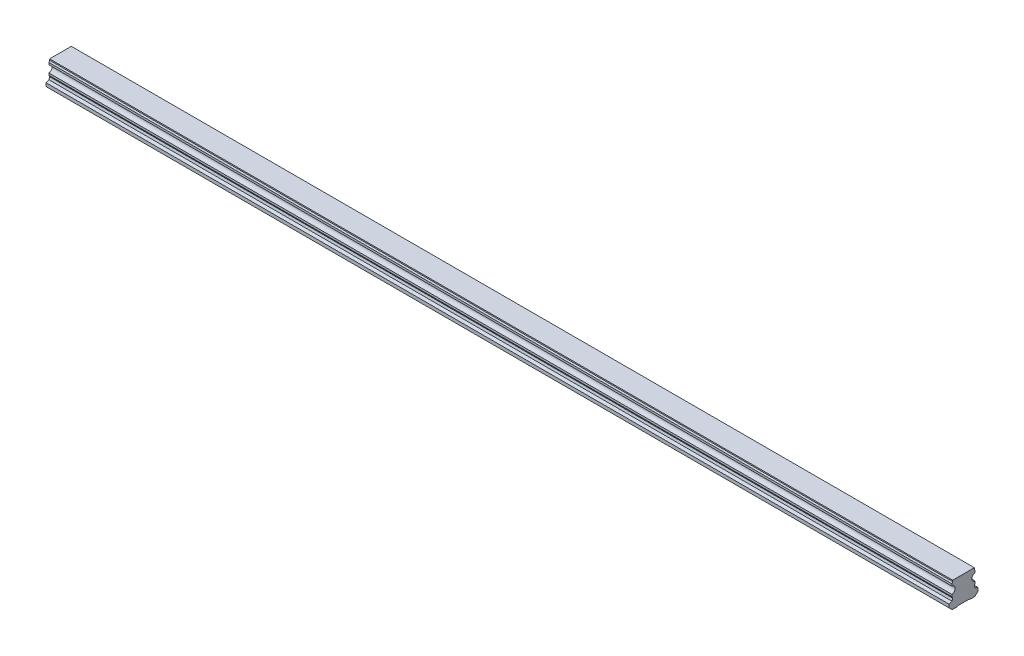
ISO-10303-21;
HEADER;
FILE_DESCRIPTION(('STEP AP214'),'2;1');
FILE_NAME('part.step','',(''),(''),'','','');
FILE_SCHEMA(('AUTOMOTIVE_DESIGN { 1 0 10303 214 1 1 1 1 }'));
ENDSEC;
DATA;
#1=APPLICATION_CONTEXT('core data for automotive mechanical design processes');
#2=APPLICATION_PROTOCOL_DEFINITION('international standard','automotive_design',2000,#1);
#3=PRODUCT_CONTEXT('',#1,'mechanical');
#4=PRODUCT('Part','Part','',(#3));
#5=PRODUCT_RELATED_PRODUCT_CATEGORY('part','',(#4));
#6=PRODUCT_DEFINITION_FORMATION('','',#4);
#7=PRODUCT_DEFINITION_CONTEXT('part definition',#1,'design');
#8=PRODUCT_DEFINITION('design','',#6,#7);
#9=PRODUCT_DEFINITION_SHAPE('','',#8);
#10=(LENGTH_UNIT() NAMED_UNIT(*) SI_UNIT(.MILLI.,.METRE.));
#11=(NAMED_UNIT(*) PLANE_ANGLE_UNIT() SI_UNIT($,.RADIAN.));
#12=(NAMED_UNIT(*) SI_UNIT($,.STERADIAN.) SOLID_ANGLE_UNIT());
#13=UNCERTAINTY_MEASURE_WITH_UNIT(LENGTH_MEASURE(1.E-05),#10,'distance_accuracy_value','');
#14=(GEOMETRIC_REPRESENTATION_CONTEXT(3) GLOBAL_UNCERTAINTY_ASSIGNED_CONTEXT((#13)) GLOBAL_UNIT_ASSIGNED_CONTEXT((#10,
#11,#12)) REPRESENTATION_CONTEXT('',''));
#15=CARTESIAN_POINT('',(0.,0.,0.));
#16=DIRECTION('',(0.,0.,1.));
#17=DIRECTION('',(1.,0.,0.));
#18=AXIS2_PLACEMENT_3D('',#15,#16,#17);
#19=CARTESIAN_POINT('',(750.,0.499999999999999,0.));
#20=DIRECTION('',(0.,-1.,0.));
#21=DIRECTION('',(0.,0.,-1.));
#22=AXIS2_PLACEMENT_3D('',#19,#20,#21);
#23=CONICAL_SURFACE('',#22,3.5,0.785398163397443);
#24=CARTESIAN_POINT('',(750.,1.00000000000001,0.));
#25=DIRECTION('',(0.,1.,0.));
#26=DIRECTION('',(0.,0.,1.));
#27=AXIS2_PLACEMENT_3D('',#24,#25,#26);
#28=CIRCLE('',#27,3.);
#29=CARTESIAN_POINT('',(750.,1.00000000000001,3.));
#30=VERTEX_POINT('',#29);
#31=EDGE_CURVE('E11',#30,#30,#28,.F.);
#32=ORIENTED_EDGE('',*,*,#31,.F.);
#33=EDGE_LOOP('',(#32));
#34=FACE_BOUND('',#33,.T.);
#35=CARTESIAN_POINT('',(750.,0.499999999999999,0.));
#36=DIRECTION('',(0.,1.,0.));
#37=DIRECTION('',(0.,0.,1.));
#38=AXIS2_PLACEMENT_3D('',#35,#36,#37);
#39=CIRCLE('',#38,3.5);
#40=CARTESIAN_POINT('',(750.,0.5,3.5));
#41=VERTEX_POINT('',#40);
#42=EDGE_CURVE('E554',#41,#41,#39,.T.);
#43=ORIENTED_EDGE('',*,*,#42,.F.);
#44=EDGE_LOOP('',(#43));
#45=FACE_BOUND('',#44,.T.);
#46=ADVANCED_FACE('F39',(#34,#45),#23,.F.);
#47=CARTESIAN_POINT('',(750.,12.,0.));
#48=DIRECTION('',(0.,-1.,0.));
#49=DIRECTION('',(0.,0.,-1.));
#50=AXIS2_PLACEMENT_3D('',#47,#48,#49);
#51=CYLINDRICAL_SURFACE('',#50,3.);
#52=ORIENTED_EDGE('',*,*,#31,.T.);
#53=EDGE_LOOP('',(#52));
#54=FACE_BOUND('',#53,.T.);
#55=CARTESIAN_POINT('',(750.,12.,0.));
#56=DIRECTION('',(0.,-1.,0.));
#57=DIRECTION('',(0.,0.,-1.));
#58=AXIS2_PLACEMENT_3D('',#55,#56,#57);
#59=CIRCLE('',#58,3.);
#60=CARTESIAN_POINT('',(750.,12.,-3.));
#61=VERTEX_POINT('',#60);
#62=EDGE_CURVE('E49',#61,#61,#59,.T.);
#63=ORIENTED_EDGE('',*,*,#62,.F.);
#64=EDGE_LOOP('',(#63));
#65=FACE_BOUND('',#64,.T.);
#66=ADVANCED_FACE('F760',(#54,#65),#51,.F.);
#67=CARTESIAN_POINT('',(750.,12.,0.));
#68=DIRECTION('',(0.,-1.,0.));
#69=DIRECTION('',(0.,0.,-1.));
#70=AXIS2_PLACEMENT_3D('',#67,#68,#69);
#71=PLANE('',#70);
#72=CARTESIAN_POINT('',(750.,12.,0.));
#73=DIRECTION('',(0.,-1.,0.));
#74=DIRECTION('',(0.,0.,-1.));
#75=AXIS2_PLACEMENT_3D('',#72,#73,#74);
#76=CIRCLE('',#75,2.5);
#77=CARTESIAN_POINT('',(750.,12.,-2.5));
#78=VERTEX_POINT('',#77);
#79=EDGE_CURVE('E42',#78,#78,#76,.T.);
#80=ORIENTED_EDGE('',*,*,#79,.F.);
#81=EDGE_LOOP('',(#80));
#82=FACE_BOUND('',#81,.T.);
#83=ORIENTED_EDGE('',*,*,#62,.T.);
#84=EDGE_LOOP('',(#83));
#85=FACE_BOUND('',#84,.T.);
#86=ADVANCED_FACE('F765',(#82,#85),#71,.T.);
#87=CARTESIAN_POINT('',(690.,0.499999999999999,0.));
#88=DIRECTION('',(0.,-1.,0.));
#89=DIRECTION('',(0.,0.,-1.));
#90=AXIS2_PLACEMENT_3D('',#87,#88,#89);
#91=CONICAL_SURFACE('',#90,3.5,0.785398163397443);
#92=CARTESIAN_POINT('',(690.,1.00000000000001,0.));
#93=DIRECTION('',(0.,1.,0.));
#94=DIRECTION('',(0.,0.,1.));
#95=AXIS2_PLACEMENT_3D('',#92,#93,#94);
#96=CIRCLE('',#95,3.);
#97=CARTESIAN_POINT('',(690.,1.00000000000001,3.));
#98=VERTEX_POINT('',#97);
#99=EDGE_CURVE('E550',#98,#98,#96,.F.);
#100=ORIENTED_EDGE('',*,*,#99,.F.);
#101=EDGE_LOOP('',(#100));
#102=FACE_BOUND('',#101,.T.);
#103=CARTESIAN_POINT('',(690.,0.499999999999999,0.));
#104=DIRECTION('',(0.,1.,0.));
#105=DIRECTION('',(0.,0.,1.));
#106=AXIS2_PLACEMENT_3D('',#103,#104,#105);
#107=CIRCLE('',#106,3.5);
#108=CARTESIAN_POINT('',(690.,0.5,3.5));
#109=VERTEX_POINT('',#108);
#110=EDGE_CURVE('E542',#109,#109,#107,.T.);
#111=ORIENTED_EDGE('',*,*,#110,.F.);
#112=EDGE_LOOP('',(#111));
#113=FACE_BOUND('',#112,.T.);
#114=ADVANCED_FACE('F960',(#102,#113),#91,.F.);
#115=CARTESIAN_POINT('',(690.,12.,0.));
#116=DIRECTION('',(0.,-1.,0.));
#117=DIRECTION('',(0.,0.,-1.));
#118=AXIS2_PLACEMENT_3D('',#115,#116,#117);
#119=CYLINDRICAL_SURFACE('',#118,3.);
#120=ORIENTED_EDGE('',*,*,#99,.T.);
#121=EDGE_LOOP('',(#120));
#122=FACE_BOUND('',#121,.T.);
#123=CARTESIAN_POINT('',(690.,12.,0.));
#124=DIRECTION('',(0.,-1.,0.));
#125=DIRECTION('',(0.,0.,-1.));
#126=AXIS2_PLACEMENT_3D('',#123,#124,#125);
#127=CIRCLE('',#126,3.);
#128=CARTESIAN_POINT('',(690.,12.,-3.));
#129=VERTEX_POINT('',#128);
#130=EDGE_CURVE('E546',#129,#129,#127,.T.);
#131=ORIENTED_EDGE('',*,*,#130,.F.);
#132=EDGE_LOOP('',(#131));
#133=FACE_BOUND('',#132,.T.);
#134=ADVANCED_FACE('F956',(#122,#133),#119,.F.);
#135=CARTESIAN_POINT('',(690.,12.,0.));
#136=DIRECTION('',(0.,-1.,0.));
#137=DIRECTION('',(0.,0.,-1.));
#138=AXIS2_PLACEMENT_3D('',#135,#136,#137);
#139=PLANE('',#138);
#140=CARTESIAN_POINT('',(690.,12.,0.));
#141=DIRECTION('',(0.,-1.,0.));
#142=DIRECTION('',(0.,0.,-1.));
#143=AXIS2_PLACEMENT_3D('',#140,#141,#142);
#144=CIRCLE('',#143,2.5);
#145=CARTESIAN_POINT('',(690.,12.,-2.5));
#146=VERTEX_POINT('',#145);
#147=EDGE_CURVE('E601',#146,#146,#144,.T.);
#148=ORIENTED_EDGE('',*,*,#147,.F.);
#149=EDGE_LOOP('',(#148));
#150=FACE_BOUND('',#149,.T.);
#151=ORIENTED_EDGE('',*,*,#130,.T.);
#152=EDGE_LOOP('',(#151));
#153=FACE_BOUND('',#152,.T.);
#154=ADVANCED_FACE('F952',(#150,#153),#139,.T.);
#155=CARTESIAN_POINT('',(630.,0.499999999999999,0.));
#156=DIRECTION('',(0.,-1.,0.));
#157=DIRECTION('',(0.,0.,-1.));
#158=AXIS2_PLACEMENT_3D('',#155,#156,#157);
#159=CONICAL_SURFACE('',#158,3.5,0.785398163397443);
#160=CARTESIAN_POINT('',(630.,1.00000000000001,0.));
#161=DIRECTION('',(0.,1.,0.));
#162=DIRECTION('',(0.,0.,1.));
#163=AXIS2_PLACEMENT_3D('',#160,#161,#162);
#164=CIRCLE('',#163,3.);
#165=CARTESIAN_POINT('',(630.,1.00000000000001,3.));
#166=VERTEX_POINT('',#165);
#167=EDGE_CURVE('E538',#166,#166,#164,.F.);
#168=ORIENTED_EDGE('',*,*,#167,.F.);
#169=EDGE_LOOP('',(#168));
#170=FACE_BOUND('',#169,.T.);
#171=CARTESIAN_POINT('',(630.,0.499999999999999,0.));
#172=DIRECTION('',(0.,1.,0.));
#173=DIRECTION('',(0.,0.,1.));
#174=AXIS2_PLACEMENT_3D('',#171,#172,#173);
#175=CIRCLE('',#174,3.5);
#176=CARTESIAN_POINT('',(630.,0.5,3.5));
#177=VERTEX_POINT('',#176);
#178=EDGE_CURVE('E530',#177,#177,#175,.T.);
#179=ORIENTED_EDGE('',*,*,#178,.F.);
#180=EDGE_LOOP('',(#179));
#181=FACE_BOUND('',#180,.T.);
#182=ADVANCED_FACE('F948',(#170,#181),#159,.F.);
#183=CARTESIAN_POINT('',(630.,12.,0.));
#184=DIRECTION('',(0.,-1.,0.));
#185=DIRECTION('',(0.,0.,-1.));
#186=AXIS2_PLACEMENT_3D('',#183,#184,#185);
#187=CYLINDRICAL_SURFACE('',#186,3.);
#188=ORIENTED_EDGE('',*,*,#167,.T.);
#189=EDGE_LOOP('',(#188));
#190=FACE_BOUND('',#189,.T.);
#191=CARTESIAN_POINT('',(630.,12.,0.));
#192=DIRECTION('',(0.,-1.,0.));
#193=DIRECTION('',(0.,0.,-1.));
#194=AXIS2_PLACEMENT_3D('',#191,#192,#193);
#195=CIRCLE('',#194,3.);
#196=CARTESIAN_POINT('',(630.,12.,-3.));
#197=VERTEX_POINT('',#196);
#198=EDGE_CURVE('E534',#197,#197,#195,.T.);
#199=ORIENTED_EDGE('',*,*,#198,.F.);
#200=EDGE_LOOP('',(#199));
#201=FACE_BOUND('',#200,.T.);
#202=ADVANCED_FACE('F944',(#190,#201),#187,.F.);
#203=CARTESIAN_POINT('',(630.,12.,0.));
#204=DIRECTION('',(0.,-1.,0.));
#205=DIRECTION('',(0.,0.,-1.));
#206=AXIS2_PLACEMENT_3D('',#203,#204,#205);
#207=PLANE('',#206);
#208=CARTESIAN_POINT('',(630.,12.,0.));
#209=DIRECTION('',(0.,-1.,0.));
#210=DIRECTION('',(0.,0.,-1.));
#211=AXIS2_PLACEMENT_3D('',#208,#209,#210);
#212=CIRCLE('',#211,2.5);
#213=CARTESIAN_POINT('',(630.,12.,-2.5));
#214=VERTEX_POINT('',#213);
#215=EDGE_CURVE('E598',#214,#214,#212,.T.);
#216=ORIENTED_EDGE('',*,*,#215,.F.);
#217=EDGE_LOOP('',(#216));
#218=FACE_BOUND('',#217,.T.);
#219=ORIENTED_EDGE('',*,*,#198,.T.);
#220=EDGE_LOOP('',(#219));
#221=FACE_BOUND('',#220,.T.);
#222=ADVANCED_FACE('F940',(#218,#221),#207,.T.);
#223=CARTESIAN_POINT('',(570.,0.499999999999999,0.));
#224=DIRECTION('',(0.,-1.,0.));
#225=DIRECTION('',(0.,0.,-1.));
#226=AXIS2_PLACEMENT_3D('',#223,#224,#225);
#227=CONICAL_SURFACE('',#226,3.5,0.785398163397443);
#228=CARTESIAN_POINT('',(570.,1.00000000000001,0.));
#229=DIRECTION('',(0.,1.,0.));
#230=DIRECTION('',(0.,0.,1.));
#231=AXIS2_PLACEMENT_3D('',#228,#229,#230);
#232=CIRCLE('',#231,3.);
#233=CARTESIAN_POINT('',(570.,1.00000000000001,3.));
#234=VERTEX_POINT('',#233);
#235=EDGE_CURVE('E526',#234,#234,#232,.F.);
#236=ORIENTED_EDGE('',*,*,#235,.F.);
#237=EDGE_LOOP('',(#236));
#238=FACE_BOUND('',#237,.T.);
#239=CARTESIAN_POINT('',(570.,0.499999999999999,0.));
#240=DIRECTION('',(0.,1.,0.));
#241=DIRECTION('',(0.,0.,1.));
#242=AXIS2_PLACEMENT_3D('',#239,#240,#241);
#243=CIRCLE('',#242,3.5);
#244=CARTESIAN_POINT('',(570.,0.5,3.5));
#245=VERTEX_POINT('',#244);
#246=EDGE_CURVE('E518',#245,#245,#243,.T.);
#247=ORIENTED_EDGE('',*,*,#246,.F.);
#248=EDGE_LOOP('',(#247));
#249=FACE_BOUND('',#248,.T.);
#250=ADVANCED_FACE('F936',(#238,#249),#227,.F.);
#251=CARTESIAN_POINT('',(570.,12.,0.));
#252=DIRECTION('',(0.,-1.,0.));
#253=DIRECTION('',(0.,0.,-1.));
#254=AXIS2_PLACEMENT_3D('',#251,#252,#253);
#255=CYLINDRICAL_SURFACE('',#254,3.);
#256=ORIENTED_EDGE('',*,*,#235,.T.);
#257=EDGE_LOOP('',(#256));
#258=FACE_BOUND('',#257,.T.);
#259=CARTESIAN_POINT('',(570.,12.,0.));
#260=DIRECTION('',(0.,-1.,0.));
#261=DIRECTION('',(0.,0.,-1.));
#262=AXIS2_PLACEMENT_3D('',#259,#260,#261);
#263=CIRCLE('',#262,3.);
#264=CARTESIAN_POINT('',(570.,12.,-3.));
#265=VERTEX_POINT('',#264);
#266=EDGE_CURVE('E522',#265,#265,#263,.T.);
#267=ORIENTED_EDGE('',*,*,#266,.F.);
#268=EDGE_LOOP('',(#267));
#269=FACE_BOUND('',#268,.T.);
#270=ADVANCED_FACE('F932',(#258,#269),#255,.F.);
#271=CARTESIAN_POINT('',(570.,12.,0.));
#272=DIRECTION('',(0.,-1.,0.));
#273=DIRECTION('',(0.,0.,-1.));
#274=AXIS2_PLACEMENT_3D('',#271,#272,#273);
#275=PLANE('',#274);
#276=CARTESIAN_POINT('',(570.,12.,0.));
#277=DIRECTION('',(0.,-1.,0.));
#278=DIRECTION('',(0.,0.,-1.));
#279=AXIS2_PLACEMENT_3D('',#276,#277,#278);
#280=CIRCLE('',#279,2.5);
#281=CARTESIAN_POINT('',(570.,12.,-2.5));
#282=VERTEX_POINT('',#281);
#283=EDGE_CURVE('E594',#282,#282,#280,.T.);
#284=ORIENTED_EDGE('',*,*,#283,.F.);
#285=EDGE_LOOP('',(#284));
#286=FACE_BOUND('',#285,.T.);
#287=ORIENTED_EDGE('',*,*,#266,.T.);
#288=EDGE_LOOP('',(#287));
#289=FACE_BOUND('',#288,.T.);
#290=ADVANCED_FACE('F928',(#286,#289),#275,.T.);
#291=CARTESIAN_POINT('',(510.,0.499999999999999,0.));
#292=DIRECTION('',(0.,-1.,0.));
#293=DIRECTION('',(0.,0.,-1.));
#294=AXIS2_PLACEMENT_3D('',#291,#292,#293);
#295=CONICAL_SURFACE('',#294,3.5,0.785398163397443);
#296=CARTESIAN_POINT('',(510.,1.00000000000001,0.));
#297=DIRECTION('',(0.,1.,0.));
#298=DIRECTION('',(0.,0.,1.));
#299=AXIS2_PLACEMENT_3D('',#296,#297,#298);
#300=CIRCLE('',#299,3.);
#301=CARTESIAN_POINT('',(510.,1.00000000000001,3.));
#302=VERTEX_POINT('',#301);
#303=EDGE_CURVE('E514',#302,#302,#300,.F.);
#304=ORIENTED_EDGE('',*,*,#303,.F.);
#305=EDGE_LOOP('',(#304));
#306=FACE_BOUND('',#305,.T.);
#307=CARTESIAN_POINT('',(510.,0.499999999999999,0.));
#308=DIRECTION('',(0.,1.,0.));
#309=DIRECTION('',(0.,0.,1.));
#310=AXIS2_PLACEMENT_3D('',#307,#308,#309);
#311=CIRCLE('',#310,3.5);
#312=CARTESIAN_POINT('',(510.,0.5,3.5));
#313=VERTEX_POINT('',#312);
#314=EDGE_CURVE('E506',#313,#313,#311,.T.);
#315=ORIENTED_EDGE('',*,*,#314,.F.);
#316=EDGE_LOOP('',(#315));
#317=FACE_BOUND('',#316,.T.);
#318=ADVANCED_FACE('F924',(#306,#317),#295,.F.);
#319=CARTESIAN_POINT('',(510.,12.,0.));
#320=DIRECTION('',(0.,-1.,0.));
#321=DIRECTION('',(0.,0.,-1.));
#322=AXIS2_PLACEMENT_3D('',#319,#320,#321);
#323=CYLINDRICAL_SURFACE('',#322,3.);
#324=ORIENTED_EDGE('',*,*,#303,.T.);
#325=EDGE_LOOP('',(#324));
#326=FACE_BOUND('',#325,.T.);
#327=CARTESIAN_POINT('',(510.,12.,0.));
#328=DIRECTION('',(0.,-1.,0.));
#329=DIRECTION('',(0.,0.,-1.));
#330=AXIS2_PLACEMENT_3D('',#327,#328,#329);
#331=CIRCLE('',#330,3.);
#332=CARTESIAN_POINT('',(510.,12.,-3.));
#333=VERTEX_POINT('',#332);
#334=EDGE_CURVE('E510',#333,#333,#331,.T.);
#335=ORIENTED_EDGE('',*,*,#334,.F.);
#336=EDGE_LOOP('',(#335));
#337=FACE_BOUND('',#336,.T.);
#338=ADVANCED_FACE('F920',(#326,#337),#323,.F.);
#339=CARTESIAN_POINT('',(510.,12.,0.));
#340=DIRECTION('',(0.,-1.,0.));
#341=DIRECTION('',(0.,0.,-1.));
#342=AXIS2_PLACEMENT_3D('',#339,#340,#341);
#343=PLANE('',#342);
#344=CARTESIAN_POINT('',(510.,12.,0.));
#345=DIRECTION('',(0.,-1.,0.));
#346=DIRECTION('',(0.,0.,-1.));
#347=AXIS2_PLACEMENT_3D('',#344,#345,#346);
#348=CIRCLE('',#347,2.5);
#349=CARTESIAN_POINT('',(510.,12.,-2.5));
#350=VERTEX_POINT('',#349);
#351=EDGE_CURVE('E590',#350,#350,#348,.T.);
#352=ORIENTED_EDGE('',*,*,#351,.F.);
#353=EDGE_LOOP('',(#352));
#354=FACE_BOUND('',#353,.T.);
#355=ORIENTED_EDGE('',*,*,#334,.T.);
#356=EDGE_LOOP('',(#355));
#357=FACE_BOUND('',#356,.T.);
#358=ADVANCED_FACE('F916',(#354,#357),#343,.T.);
#359=CARTESIAN_POINT('',(450.,0.499999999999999,0.));
#360=DIRECTION('',(0.,-1.,0.));
#361=DIRECTION('',(0.,0.,-1.));
#362=AXIS2_PLACEMENT_3D('',#359,#360,#361);
#363=CONICAL_SURFACE('',#362,3.5,0.785398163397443);
#364=CARTESIAN_POINT('',(450.,1.00000000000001,0.));
#365=DIRECTION('',(0.,1.,0.));
#366=DIRECTION('',(0.,0.,1.));
#367=AXIS2_PLACEMENT_3D('',#364,#365,#366);
#368=CIRCLE('',#367,3.);
#369=CARTESIAN_POINT('',(450.,1.00000000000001,3.));
#370=VERTEX_POINT('',#369);
#371=EDGE_CURVE('E502',#370,#370,#368,.F.);
#372=ORIENTED_EDGE('',*,*,#371,.F.);
#373=EDGE_LOOP('',(#372));
#374=FACE_BOUND('',#373,.T.);
#375=CARTESIAN_POINT('',(450.,0.499999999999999,0.));
#376=DIRECTION('',(0.,1.,0.));
#377=DIRECTION('',(0.,0.,1.));
#378=AXIS2_PLACEMENT_3D('',#375,#376,#377);
#379=CIRCLE('',#378,3.5);
#380=CARTESIAN_POINT('',(450.,0.5,3.5));
#381=VERTEX_POINT('',#380);
#382=EDGE_CURVE('E494',#381,#381,#379,.T.);
#383=ORIENTED_EDGE('',*,*,#382,.F.);
#384=EDGE_LOOP('',(#383));
#385=FACE_BOUND('',#384,.T.);
#386=ADVANCED_FACE('F912',(#374,#385),#363,.F.);
#387=CARTESIAN_POINT('',(450.,12.,0.));
#388=DIRECTION('',(0.,-1.,0.));
#389=DIRECTION('',(0.,0.,-1.));
#390=AXIS2_PLACEMENT_3D('',#387,#388,#389);
#391=CYLINDRICAL_SURFACE('',#390,3.);
#392=ORIENTED_EDGE('',*,*,#371,.T.);
#393=EDGE_LOOP('',(#392));
#394=FACE_BOUND('',#393,.T.);
#395=CARTESIAN_POINT('',(450.,12.,0.));
#396=DIRECTION('',(0.,-1.,0.));
#397=DIRECTION('',(0.,0.,-1.));
#398=AXIS2_PLACEMENT_3D('',#395,#396,#397);
#399=CIRCLE('',#398,3.);
#400=CARTESIAN_POINT('',(450.,12.,-3.));
#401=VERTEX_POINT('',#400);
#402=EDGE_CURVE('E498',#401,#401,#399,.T.);
#403=ORIENTED_EDGE('',*,*,#402,.F.);
#404=EDGE_LOOP('',(#403));
#405=FACE_BOUND('',#404,.T.);
#406=ADVANCED_FACE('F908',(#394,#405),#391,.F.);
#407=CARTESIAN_POINT('',(450.,12.,0.));
#408=DIRECTION('',(0.,-1.,0.));
#409=DIRECTION('',(0.,0.,-1.));
#410=AXIS2_PLACEMENT_3D('',#407,#408,#409);
#411=PLANE('',#410);
#412=CARTESIAN_POINT('',(450.,12.,0.));
#413=DIRECTION('',(0.,-1.,0.));
#414=DIRECTION('',(0.,0.,-1.));
#415=AXIS2_PLACEMENT_3D('',#412,#413,#414);
#416=CIRCLE('',#415,2.5);
#417=CARTESIAN_POINT('',(450.,12.,-2.5));
#418=VERTEX_POINT('',#417);
#419=EDGE_CURVE('E586',#418,#418,#416,.T.);
#420=ORIENTED_EDGE('',*,*,#419,.F.);
#421=EDGE_LOOP('',(#420));
#422=FACE_BOUND('',#421,.T.);
#423=ORIENTED_EDGE('',*,*,#402,.T.);
#424=EDGE_LOOP('',(#423));
#425=FACE_BOUND('',#424,.T.);
#426=ADVANCED_FACE('F904',(#422,#425),#411,.T.);
#427=CARTESIAN_POINT('',(390.,0.499999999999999,0.));
#428=DIRECTION('',(0.,-1.,0.));
#429=DIRECTION('',(0.,0.,-1.));
#430=AXIS2_PLACEMENT_3D('',#427,#428,#429);
#431=CONICAL_SURFACE('',#430,3.5,0.785398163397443);
#432=CARTESIAN_POINT('',(390.,1.00000000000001,0.));
#433=DIRECTION('',(0.,1.,0.));
#434=DIRECTION('',(0.,0.,1.));
#435=AXIS2_PLACEMENT_3D('',#432,#433,#434);
#436=CIRCLE('',#435,3.);
#437=CARTESIAN_POINT('',(390.,1.00000000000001,3.));
#438=VERTEX_POINT('',#437);
#439=EDGE_CURVE('E490',#438,#438,#436,.F.);
#440=ORIENTED_EDGE('',*,*,#439,.F.);
#441=EDGE_LOOP('',(#440));
#442=FACE_BOUND('',#441,.T.);
#443=CARTESIAN_POINT('',(390.,0.499999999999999,0.));
#444=DIRECTION('',(0.,1.,0.));
#445=DIRECTION('',(0.,0.,1.));
#446=AXIS2_PLACEMENT_3D('',#443,#444,#445);
#447=CIRCLE('',#446,3.5);
#448=CARTESIAN_POINT('',(390.,0.5,3.5));
#449=VERTEX_POINT('',#448);
#450=EDGE_CURVE('E482',#449,#449,#447,.T.);
#451=ORIENTED_EDGE('',*,*,#450,.F.);
#452=EDGE_LOOP('',(#451));
#453=FACE_BOUND('',#452,.T.);
#454=ADVANCED_FACE('F900',(#442,#453),#431,.F.);
#455=CARTESIAN_POINT('',(390.,12.,0.));
#456=DIRECTION('',(0.,-1.,0.));
#457=DIRECTION('',(0.,0.,-1.));
#458=AXIS2_PLACEMENT_3D('',#455,#456,#457);
#459=CYLINDRICAL_SURFACE('',#458,3.);
#460=ORIENTED_EDGE('',*,*,#439,.T.);
#461=EDGE_LOOP('',(#460));
#462=FACE_BOUND('',#461,.T.);
#463=CARTESIAN_POINT('',(390.,12.,0.));
#464=DIRECTION('',(0.,-1.,0.));
#465=DIRECTION('',(0.,0.,-1.));
#466=AXIS2_PLACEMENT_3D('',#463,#464,#465);
#467=CIRCLE('',#466,3.);
#468=CARTESIAN_POINT('',(390.,12.,-3.));
#469=VERTEX_POINT('',#468);
#470=EDGE_CURVE('E486',#469,#469,#467,.T.);
#471=ORIENTED_EDGE('',*,*,#470,.F.);
#472=EDGE_LOOP('',(#471));
#473=FACE_BOUND('',#472,.T.);
#474=ADVANCED_FACE('F896',(#462,#473),#459,.F.);
#475=CARTESIAN_POINT('',(390.,12.,0.));
#476=DIRECTION('',(0.,-1.,0.));
#477=DIRECTION('',(0.,0.,-1.));
#478=AXIS2_PLACEMENT_3D('',#475,#476,#477);
#479=PLANE('',#478);
#480=CARTESIAN_POINT('',(390.,12.,0.));
#481=DIRECTION('',(0.,-1.,0.));
#482=DIRECTION('',(0.,0.,-1.));
#483=AXIS2_PLACEMENT_3D('',#480,#481,#482);
#484=CIRCLE('',#483,2.5);
#485=CARTESIAN_POINT('',(390.,12.,-2.5));
#486=VERTEX_POINT('',#485);
#487=EDGE_CURVE('E582',#486,#486,#484,.T.);
#488=ORIENTED_EDGE('',*,*,#487,.F.);
#489=EDGE_LOOP('',(#488));
#490=FACE_BOUND('',#489,.T.);
#491=ORIENTED_EDGE('',*,*,#470,.T.);
#492=EDGE_LOOP('',(#491));
#493=FACE_BOUND('',#492,.T.);
#494=ADVANCED_FACE('F892',(#490,#493),#479,.T.);
#495=CARTESIAN_POINT('',(330.,0.499999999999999,0.));
#496=DIRECTION('',(0.,-1.,0.));
#497=DIRECTION('',(0.,0.,-1.));
#498=AXIS2_PLACEMENT_3D('',#495,#496,#497);
#499=CONICAL_SURFACE('',#498,3.5,0.785398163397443);
#500=CARTESIAN_POINT('',(330.,1.00000000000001,0.));
#501=DIRECTION('',(0.,1.,0.));
#502=DIRECTION('',(0.,0.,1.));
#503=AXIS2_PLACEMENT_3D('',#500,#501,#502);
#504=CIRCLE('',#503,3.);
#505=CARTESIAN_POINT('',(330.,1.00000000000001,3.));
#506=VERTEX_POINT('',#505);
#507=EDGE_CURVE('E478',#506,#506,#504,.F.);
#508=ORIENTED_EDGE('',*,*,#507,.F.);
#509=EDGE_LOOP('',(#508));
#510=FACE_BOUND('',#509,.T.);
#511=CARTESIAN_POINT('',(330.,0.499999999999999,0.));
#512=DIRECTION('',(0.,1.,0.));
#513=DIRECTION('',(0.,0.,1.));
#514=AXIS2_PLACEMENT_3D('',#511,#512,#513);
#515=CIRCLE('',#514,3.5);
#516=CARTESIAN_POINT('',(330.,0.5,3.5));
#517=VERTEX_POINT('',#516);
#518=EDGE_CURVE('E470',#517,#517,#515,.T.);
#519=ORIENTED_EDGE('',*,*,#518,.F.);
#520=EDGE_LOOP('',(#519));
#521=FACE_BOUND('',#520,.T.);
#522=ADVANCED_FACE('F888',(#510,#521),#499,.F.);
#523=CARTESIAN_POINT('',(330.,12.,0.));
#524=DIRECTION('',(0.,-1.,0.));
#525=DIRECTION('',(0.,0.,-1.));
#526=AXIS2_PLACEMENT_3D('',#523,#524,#525);
#527=CYLINDRICAL_SURFACE('',#526,3.);
#528=ORIENTED_EDGE('',*,*,#507,.T.);
#529=EDGE_LOOP('',(#528));
#530=FACE_BOUND('',#529,.T.);
#531=CARTESIAN_POINT('',(330.,12.,0.));
#532=DIRECTION('',(0.,-1.,0.));
#533=DIRECTION('',(0.,0.,-1.));
#534=AXIS2_PLACEMENT_3D('',#531,#532,#533);
#535=CIRCLE('',#534,3.);
#536=CARTESIAN_POINT('',(330.,12.,-3.));
#537=VERTEX_POINT('',#536);
#538=EDGE_CURVE('E474',#537,#537,#535,.T.);
#539=ORIENTED_EDGE('',*,*,#538,.F.);
#540=EDGE_LOOP('',(#539));
#541=FACE_BOUND('',#540,.T.);
#542=ADVANCED_FACE('F884',(#530,#541),#527,.F.);
#543=CARTESIAN_POINT('',(330.,12.,0.));
#544=DIRECTION('',(0.,-1.,0.));
#545=DIRECTION('',(0.,0.,-1.));
#546=AXIS2_PLACEMENT_3D('',#543,#544,#545);
#547=PLANE('',#546);
#548=CARTESIAN_POINT('',(330.,12.,0.));
#549=DIRECTION('',(0.,-1.,0.));
#550=DIRECTION('',(0.,0.,-1.));
#551=AXIS2_PLACEMENT_3D('',#548,#549,#550);
#552=CIRCLE('',#551,2.5);
#553=CARTESIAN_POINT('',(330.,12.,-2.5));
#554=VERTEX_POINT('',#553);
#555=EDGE_CURVE('E578',#554,#554,#552,.T.);
#556=ORIENTED_EDGE('',*,*,#555,.F.);
#557=EDGE_LOOP('',(#556));
#558=FACE_BOUND('',#557,.T.);
#559=ORIENTED_EDGE('',*,*,#538,.T.);
#560=EDGE_LOOP('',(#559));
#561=FACE_BOUND('',#560,.T.);
#562=ADVANCED_FACE('F880',(#558,#561),#547,.T.);
#563=CARTESIAN_POINT('',(270.,0.499999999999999,0.));
#564=DIRECTION('',(0.,-1.,0.));
#565=DIRECTION('',(0.,0.,-1.));
#566=AXIS2_PLACEMENT_3D('',#563,#564,#565);
#567=CONICAL_SURFACE('',#566,3.5,0.785398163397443);
#568=CARTESIAN_POINT('',(270.,1.00000000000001,0.));
#569=DIRECTION('',(0.,1.,0.));
#570=DIRECTION('',(0.,0.,1.));
#571=AXIS2_PLACEMENT_3D('',#568,#569,#570);
#572=CIRCLE('',#571,3.);
#573=CARTESIAN_POINT('',(270.,1.00000000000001,3.));
#574=VERTEX_POINT('',#573);
#575=EDGE_CURVE('E466',#574,#574,#572,.F.);
#576=ORIENTED_EDGE('',*,*,#575,.F.);
#577=EDGE_LOOP('',(#576));
#578=FACE_BOUND('',#577,.T.);
#579=CARTESIAN_POINT('',(270.,0.499999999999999,0.));
#580=DIRECTION('',(0.,1.,0.));
#581=DIRECTION('',(0.,0.,1.));
#582=AXIS2_PLACEMENT_3D('',#579,#580,#581);
#583=CIRCLE('',#582,3.5);
#584=CARTESIAN_POINT('',(270.,0.5,3.5));
#585=VERTEX_POINT('',#584);
#586=EDGE_CURVE('E458',#585,#585,#583,.T.);
#587=ORIENTED_EDGE('',*,*,#586,.F.);
#588=EDGE_LOOP('',(#587));
#589=FACE_BOUND('',#588,.T.);
#590=ADVANCED_FACE('F876',(#578,#589),#567,.F.);
#591=CARTESIAN_POINT('',(270.,12.,0.));
#592=DIRECTION('',(0.,-1.,0.));
#593=DIRECTION('',(0.,0.,-1.));
#594=AXIS2_PLACEMENT_3D('',#591,#592,#593);
#595=CYLINDRICAL_SURFACE('',#594,3.);
#596=ORIENTED_EDGE('',*,*,#575,.T.);
#597=EDGE_LOOP('',(#596));
#598=FACE_BOUND('',#597,.T.);
#599=CARTESIAN_POINT('',(270.,12.,0.));
#600=DIRECTION('',(0.,-1.,0.));
#601=DIRECTION('',(0.,0.,-1.));
#602=AXIS2_PLACEMENT_3D('',#599,#600,#601);
#603=CIRCLE('',#602,3.);
#604=CARTESIAN_POINT('',(270.,12.,-3.));
#605=VERTEX_POINT('',#604);
#606=EDGE_CURVE('E462',#605,#605,#603,.T.);
#607=ORIENTED_EDGE('',*,*,#606,.F.);
#608=EDGE_LOOP('',(#607));
#609=FACE_BOUND('',#608,.T.);
#610=ADVANCED_FACE('F872',(#598,#609),#595,.F.);
#611=CARTESIAN_POINT('',(270.,12.,0.));
#612=DIRECTION('',(0.,-1.,0.));
#613=DIRECTION('',(0.,0.,-1.));
#614=AXIS2_PLACEMENT_3D('',#611,#612,#613);
#615=PLANE('',#614);
#616=CARTESIAN_POINT('',(270.,12.,0.));
#617=DIRECTION('',(0.,-1.,0.));
#618=DIRECTION('',(0.,0.,-1.));
#619=AXIS2_PLACEMENT_3D('',#616,#617,#618);
#620=CIRCLE('',#619,2.5);
#621=CARTESIAN_POINT('',(270.,12.,-2.5));
#622=VERTEX_POINT('',#621);
#623=EDGE_CURVE('E574',#622,#622,#620,.T.);
#624=ORIENTED_EDGE('',*,*,#623,.F.);
#625=EDGE_LOOP('',(#624));
#626=FACE_BOUND('',#625,.T.);
#627=ORIENTED_EDGE('',*,*,#606,.T.);
#628=EDGE_LOOP('',(#627));
#629=FACE_BOUND('',#628,.T.);
#630=ADVANCED_FACE('F868',(#626,#629),#615,.T.);
#631=CARTESIAN_POINT('',(210.,0.499999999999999,0.));
#632=DIRECTION('',(0.,-1.,0.));
#633=DIRECTION('',(0.,0.,-1.));
#634=AXIS2_PLACEMENT_3D('',#631,#632,#633);
#635=CONICAL_SURFACE('',#634,3.5,0.785398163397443);
#636=CARTESIAN_POINT('',(210.,1.00000000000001,0.));
#637=DIRECTION('',(0.,1.,0.));
#638=DIRECTION('',(0.,0.,1.));
#639=AXIS2_PLACEMENT_3D('',#636,#637,#638);
#640=CIRCLE('',#639,3.);
#641=CARTESIAN_POINT('',(210.,1.00000000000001,3.));
#642=VERTEX_POINT('',#641);
#643=EDGE_CURVE('E454',#642,#642,#640,.F.);
#644=ORIENTED_EDGE('',*,*,#643,.F.);
#645=EDGE_LOOP('',(#644));
#646=FACE_BOUND('',#645,.T.);
#647=CARTESIAN_POINT('',(210.,0.499999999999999,0.));
#648=DIRECTION('',(0.,1.,0.));
#649=DIRECTION('',(0.,0.,1.));
#650=AXIS2_PLACEMENT_3D('',#647,#648,#649);
#651=CIRCLE('',#650,3.5);
#652=CARTESIAN_POINT('',(210.,0.5,3.5));
#653=VERTEX_POINT('',#652);
#654=EDGE_CURVE('E446',#653,#653,#651,.T.);
#655=ORIENTED_EDGE('',*,*,#654,.F.);
#656=EDGE_LOOP('',(#655));
#657=FACE_BOUND('',#656,.T.);
#658=ADVANCED_FACE('F864',(#646,#657),#635,.F.);
#659=CARTESIAN_POINT('',(210.,12.,0.));
#660=DIRECTION('',(0.,-1.,0.));
#661=DIRECTION('',(0.,0.,-1.));
#662=AXIS2_PLACEMENT_3D('',#659,#660,#661);
#663=CYLINDRICAL_SURFACE('',#662,3.);
#664=ORIENTED_EDGE('',*,*,#643,.T.);
#665=EDGE_LOOP('',(#664));
#666=FACE_BOUND('',#665,.T.);
#667=CARTESIAN_POINT('',(210.,12.,0.));
#668=DIRECTION('',(0.,-1.,0.));
#669=DIRECTION('',(0.,0.,-1.));
#670=AXIS2_PLACEMENT_3D('',#667,#668,#669);
#671=CIRCLE('',#670,3.);
#672=CARTESIAN_POINT('',(210.,12.,-3.));
#673=VERTEX_POINT('',#672);
#674=EDGE_CURVE('E450',#673,#673,#671,.T.);
#675=ORIENTED_EDGE('',*,*,#674,.F.);
#676=EDGE_LOOP('',(#675));
#677=FACE_BOUND('',#676,.T.);
#678=ADVANCED_FACE('F860',(#666,#677),#663,.F.);
#679=CARTESIAN_POINT('',(210.,12.,0.));
#680=DIRECTION('',(0.,-1.,0.));
#681=DIRECTION('',(0.,0.,-1.));
#682=AXIS2_PLACEMENT_3D('',#679,#680,#681);
#683=PLANE('',#682);
#684=CARTESIAN_POINT('',(210.,12.,0.));
#685=DIRECTION('',(0.,-1.,0.));
#686=DIRECTION('',(0.,0.,-1.));
#687=AXIS2_PLACEMENT_3D('',#684,#685,#686);
#688=CIRCLE('',#687,2.5);
#689=CARTESIAN_POINT('',(210.,12.,-2.5));
#690=VERTEX_POINT('',#689);
#691=EDGE_CURVE('E570',#690,#690,#688,.T.);
#692=ORIENTED_EDGE('',*,*,#691,.F.);
#693=EDGE_LOOP('',(#692));
#694=FACE_BOUND('',#693,.T.);
#695=ORIENTED_EDGE('',*,*,#674,.T.);
#696=EDGE_LOOP('',(#695));
#697=FACE_BOUND('',#696,.T.);
#698=ADVANCED_FACE('F856',(#694,#697),#683,.T.);
#699=CARTESIAN_POINT('',(150.,0.499999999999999,0.));
#700=DIRECTION('',(0.,-1.,0.));
#701=DIRECTION('',(0.,0.,-1.));
#702=AXIS2_PLACEMENT_3D('',#699,#700,#701);
#703=CONICAL_SURFACE('',#702,3.5,0.785398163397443);
#704=CARTESIAN_POINT('',(150.,1.00000000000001,0.));
#705=DIRECTION('',(0.,1.,0.));
#706=DIRECTION('',(0.,0.,1.));
#707=AXIS2_PLACEMENT_3D('',#704,#705,#706);
#708=CIRCLE('',#707,3.);
#709=CARTESIAN_POINT('',(150.,1.00000000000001,3.));
#710=VERTEX_POINT('',#709);
#711=EDGE_CURVE('E442',#710,#710,#708,.F.);
#712=ORIENTED_EDGE('',*,*,#711,.F.);
#713=EDGE_LOOP('',(#712));
#714=FACE_BOUND('',#713,.T.);
#715=CARTESIAN_POINT('',(150.,0.499999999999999,0.));
#716=DIRECTION('',(0.,1.,0.));
#717=DIRECTION('',(0.,0.,1.));
#718=AXIS2_PLACEMENT_3D('',#715,#716,#717);
#719=CIRCLE('',#718,3.5);
#720=CARTESIAN_POINT('',(150.,0.5,3.5));
#721=VERTEX_POINT('',#720);
#722=EDGE_CURVE('E434',#721,#721,#719,.T.);
#723=ORIENTED_EDGE('',*,*,#722,.F.);
#724=EDGE_LOOP('',(#723));
#725=FACE_BOUND('',#724,.T.);
#726=ADVANCED_FACE('F852',(#714,#725),#703,.F.);
#727=CARTESIAN_POINT('',(150.,12.,0.));
#728=DIRECTION('',(0.,-1.,0.));
#729=DIRECTION('',(0.,0.,-1.));
#730=AXIS2_PLACEMENT_3D('',#727,#728,#729);
#731=CYLINDRICAL_SURFACE('',#730,3.);
#732=ORIENTED_EDGE('',*,*,#711,.T.);
#733=EDGE_LOOP('',(#732));
#734=FACE_BOUND('',#733,.T.);
#735=CARTESIAN_POINT('',(150.,12.,0.));
#736=DIRECTION('',(0.,-1.,0.));
#737=DIRECTION('',(0.,0.,-1.));
#738=AXIS2_PLACEMENT_3D('',#735,#736,#737);
#739=CIRCLE('',#738,3.);
#740=CARTESIAN_POINT('',(150.,12.,-3.));
#741=VERTEX_POINT('',#740);
#742=EDGE_CURVE('E438',#741,#741,#739,.T.);
#743=ORIENTED_EDGE('',*,*,#742,.F.);
#744=EDGE_LOOP('',(#743));
#745=FACE_BOUND('',#744,.T.);
#746=ADVANCED_FACE('F848',(#734,#745),#731,.F.);
#747=CARTESIAN_POINT('',(150.,12.,0.));
#748=DIRECTION('',(0.,-1.,0.));
#749=DIRECTION('',(0.,0.,-1.));
#750=AXIS2_PLACEMENT_3D('',#747,#748,#749);
#751=PLANE('',#750);
#752=CARTESIAN_POINT('',(150.,12.,0.));
#753=DIRECTION('',(0.,-1.,0.));
#754=DIRECTION('',(0.,0.,-1.));
#755=AXIS2_PLACEMENT_3D('',#752,#753,#754);
#756=CIRCLE('',#755,2.5);
#757=CARTESIAN_POINT('',(150.,12.,-2.5));
#758=VERTEX_POINT('',#757);
#759=EDGE_CURVE('E565',#758,#758,#756,.T.);
#760=ORIENTED_EDGE('',*,*,#759,.F.);
#761=EDGE_LOOP('',(#760));
#762=FACE_BOUND('',#761,.T.);
#763=ORIENTED_EDGE('',*,*,#742,.T.);
#764=EDGE_LOOP('',(#763));
#765=FACE_BOUND('',#764,.T.);
#766=ADVANCED_FACE('F838',(#762,#765),#751,.T.);
#767=CARTESIAN_POINT('',(780.,21.8,-9.375));
#768=DIRECTION('',(0.,0.,1.));
#769=DIRECTION('',(0.,-1.,0.));
#770=AXIS2_PLACEMENT_3D('',#767,#768,#769);
#771=PLANE('',#770);
#772=DIRECTION('',(0.,1.,0.));
#773=VECTOR('',#772,1.);
#774=CARTESIAN_POINT('',(0.,21.8,-9.375));
#775=LINE('',#774,#773);
#776=CARTESIAN_POINT('',(0.,20.756,-9.375));
#777=VERTEX_POINT('',#776);
#778=CARTESIAN_POINT('',(0.,21.8,-9.375));
#779=VERTEX_POINT('',#778);
#780=EDGE_CURVE('E255',#777,#779,#775,.T.);
#781=ORIENTED_EDGE('',*,*,#780,.T.);
#782=DIRECTION('',(-1.,0.,0.));
#783=VECTOR('',#782,1.);
#784=CARTESIAN_POINT('',(780.,21.8,-9.375));
#785=LINE('',#784,#783);
#786=CARTESIAN_POINT('',(780.,21.8,-9.375));
#787=VERTEX_POINT('',#786);
#788=EDGE_CURVE('E423',#787,#779,#785,.T.);
#789=ORIENTED_EDGE('',*,*,#788,.F.);
#790=DIRECTION('',(0.,1.,0.));
#791=VECTOR('',#790,1.);
#792=CARTESIAN_POINT('',(780.,21.8,-9.375));
#793=LINE('',#792,#791);
#794=CARTESIAN_POINT('',(780.,20.756,-9.375));
#795=VERTEX_POINT('',#794);
#796=EDGE_CURVE('E332',#795,#787,#793,.T.);
#797=ORIENTED_EDGE('',*,*,#796,.F.);
#798=DIRECTION('',(-1.,0.,0.));
#799=VECTOR('',#798,1.);
#800=CARTESIAN_POINT('',(780.,20.756,-9.375));
#801=LINE('',#800,#799);
#802=EDGE_CURVE('E251',#795,#777,#801,.T.);
#803=ORIENTED_EDGE('',*,*,#802,.T.);
#804=EDGE_LOOP('',(#781,#789,#797,#803));
#805=FACE_BOUND('',#804,.T.);
#806=ADVANCED_FACE('F835',(#805),#771,.F.);
#807=CARTESIAN_POINT('',(780.,21.8,-9.375));
#808=DIRECTION('',(0.,-1.,0.));
#809=DIRECTION('',(0.,0.,-1.));
#810=AXIS2_PLACEMENT_3D('',#807,#808,#809);
#811=PLANE('',#810);
#812=DIRECTION('',(0.,0.,1.));
#813=VECTOR('',#812,1.);
#814=CARTESIAN_POINT('',(0.,21.8,-9.375));
#815=LINE('',#814,#813);
#816=CARTESIAN_POINT('',(0.,21.8,9.375));
#817=VERTEX_POINT('',#816);
#818=EDGE_CURVE('E259',#779,#817,#815,.T.);
#819=ORIENTED_EDGE('',*,*,#818,.T.);
#820=DIRECTION('',(-1.,0.,0.));
#821=VECTOR('',#820,1.);
#822=CARTESIAN_POINT('',(780.,21.8,9.375));
#823=LINE('',#822,#821);
#824=CARTESIAN_POINT('',(780.,21.8,9.375));
#825=VERTEX_POINT('',#824);
#826=EDGE_CURVE('E419',#825,#817,#823,.T.);
#827=ORIENTED_EDGE('',*,*,#826,.F.);
#828=DIRECTION('',(0.,0.,1.));
#829=VECTOR('',#828,1.);
#830=CARTESIAN_POINT('',(780.,21.8,-9.375));
#831=LINE('',#830,#829);
#832=EDGE_CURVE('E157',#787,#825,#831,.T.);
#833=ORIENTED_EDGE('',*,*,#832,.F.);
#834=ORIENTED_EDGE('',*,*,#788,.T.);
#835=EDGE_LOOP('',(#819,#827,#833,#834));
#836=FACE_BOUND('',#835,.T.);
#837=ADVANCED_FACE('F831',(#836),#811,.F.);
#838=CARTESIAN_POINT('',(780.,21.8,9.375));
#839=DIRECTION('',(0.,0.,-1.));
#840=DIRECTION('',(0.,1.,0.));
#841=AXIS2_PLACEMENT_3D('',#838,#839,#840);
#842=PLANE('',#841);
#843=DIRECTION('',(0.,-1.,0.));
#844=VECTOR('',#843,1.);
#845=CARTESIAN_POINT('',(0.,21.8,9.375));
#846=LINE('',#845,#844);
#847=CARTESIAN_POINT('',(0.,20.756,9.37499999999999));
#848=VERTEX_POINT('',#847);
#849=EDGE_CURVE('E263',#817,#848,#846,.T.);
#850=ORIENTED_EDGE('',*,*,#849,.T.);
#851=DIRECTION('',(-1.,0.,0.));
#852=VECTOR('',#851,1.);
#853=CARTESIAN_POINT('',(780.,20.756,9.37499999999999));
#854=LINE('',#853,#852);
#855=CARTESIAN_POINT('',(780.,20.756,9.37499999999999));
#856=VERTEX_POINT('',#855);
#857=EDGE_CURVE('E415',#856,#848,#854,.T.);
#858=ORIENTED_EDGE('',*,*,#857,.F.);
#859=DIRECTION('',(0.,-1.,0.));
#860=VECTOR('',#859,1.);
#861=CARTESIAN_POINT('',(780.,21.8,9.375));
#862=LINE('',#861,#860);
#863=EDGE_CURVE('E644',#825,#856,#862,.T.);
#864=ORIENTED_EDGE('',*,*,#863,.F.);
#865=ORIENTED_EDGE('',*,*,#826,.T.);
#866=EDGE_LOOP('',(#850,#858,#864,#865));
#867=FACE_BOUND('',#866,.T.);
#868=ADVANCED_FACE('F827',(#867),#842,.F.);
#869=CARTESIAN_POINT('',(780.,20.756,9.37499999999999));
#870=DIRECTION('',(0.,-0.422618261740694,-0.906307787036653));
#871=DIRECTION('',(0.,0.906307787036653,-0.422618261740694));
#872=AXIS2_PLACEMENT_3D('',#869,#870,#871);
#873=PLANE('',#872);
#874=DIRECTION('',(0.,-0.906307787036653,0.422618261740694));
#875=VECTOR('',#874,1.);
#876=CARTESIAN_POINT('',(0.,20.756,9.37499999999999));
#877=LINE('',#876,#875);
#878=CARTESIAN_POINT('',(0.,19.4156831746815,10.));
#879=VERTEX_POINT('',#878);
#880=EDGE_CURVE('E266',#848,#879,#877,.T.);
#881=ORIENTED_EDGE('',*,*,#880,.T.);
#882=DIRECTION('',(-1.,0.,0.));
#883=VECTOR('',#882,1.);
#884=CARTESIAN_POINT('',(780.,19.4156831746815,10.));
#885=LINE('',#884,#883);
#886=CARTESIAN_POINT('',(780.,19.4156831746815,10.));
#887=VERTEX_POINT('',#886);
#888=EDGE_CURVE('E411',#887,#879,#885,.T.);
#889=ORIENTED_EDGE('',*,*,#888,.F.);
#890=DIRECTION('',(0.,-0.906307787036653,0.422618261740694));
#891=VECTOR('',#890,1.);
#892=CARTESIAN_POINT('',(780.,20.756,9.37499999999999));
#893=LINE('',#892,#891);
#894=EDGE_CURVE('E647',#856,#887,#893,.T.);
#895=ORIENTED_EDGE('',*,*,#894,.F.);
#896=ORIENTED_EDGE('',*,*,#857,.T.);
#897=EDGE_LOOP('',(#881,#889,#895,#896));
#898=FACE_BOUND('',#897,.T.);
#899=ADVANCED_FACE('F823',(#898),#873,.F.);
#900=CARTESIAN_POINT('',(780.,19.4156831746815,10.));
#901=DIRECTION('',(0.,0.,-1.));
#902=DIRECTION('',(-1.,0.,0.));
#903=AXIS2_PLACEMENT_3D('',#900,#901,#902);
#904=PLANE('',#903);
#905=DIRECTION('',(0.,-1.,0.));
#906=VECTOR('',#905,1.);
#907=CARTESIAN_POINT('',(0.,19.4156831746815,10.));
#908=LINE('',#907,#906);
#909=CARTESIAN_POINT('',(0.,17.6854497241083,10.));
#910=VERTEX_POINT('',#909);
#911=EDGE_CURVE('E269',#879,#910,#908,.T.);
#912=ORIENTED_EDGE('',*,*,#911,.T.);
#913=DIRECTION('',(-1.,0.,0.));
#914=VECTOR('',#913,1.);
#915=CARTESIAN_POINT('',(780.,17.6854497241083,10.));
#916=LINE('',#915,#914);
#917=CARTESIAN_POINT('',(780.,17.6854497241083,10.));
#918=VERTEX_POINT('',#917);
#919=EDGE_CURVE('E407',#918,#910,#916,.T.);
#920=ORIENTED_EDGE('',*,*,#919,.F.);
#921=DIRECTION('',(0.,-1.,0.));
#922=VECTOR('',#921,1.);
#923=CARTESIAN_POINT('',(780.,19.4156831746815,10.));
#924=LINE('',#923,#922);
#925=EDGE_CURVE('E650',#887,#918,#924,.T.);
#926=ORIENTED_EDGE('',*,*,#925,.F.);
#927=ORIENTED_EDGE('',*,*,#888,.T.);
#928=EDGE_LOOP('',(#912,#920,#926,#927));
#929=FACE_BOUND('',#928,.T.);
#930=ADVANCED_FACE('F819',(#929),#904,.F.);
#931=CARTESIAN_POINT('',(780.,14.6,10.3));
#932=DIRECTION('',(-1.,0.,0.));
#933=DIRECTION('',(0.,0.,1.));
#934=AXIS2_PLACEMENT_3D('',#931,#932,#933);
#935=CYLINDRICAL_SURFACE('',#934,3.1);
#936=CARTESIAN_POINT('',(0.,14.6,10.3));
#937=DIRECTION('',(-1.,0.,0.));
#938=DIRECTION('',(0.,0.,-1.));
#939=AXIS2_PLACEMENT_3D('',#936,#937,#938);
#940=CIRCLE('',#939,3.1);
#941=CARTESIAN_POINT('',(0.,11.5145502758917,10.));
#942=VERTEX_POINT('',#941);
#943=EDGE_CURVE('E272',#910,#942,#940,.T.);
#944=ORIENTED_EDGE('',*,*,#943,.T.);
#945=DIRECTION('',(-1.,0.,0.));
#946=VECTOR('',#945,1.);
#947=CARTESIAN_POINT('',(780.,11.5145502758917,10.));
#948=LINE('',#947,#946);
#949=CARTESIAN_POINT('',(780.,11.5145502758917,10.));
#950=VERTEX_POINT('',#949);
#951=EDGE_CURVE('E403',#950,#942,#948,.T.);
#952=ORIENTED_EDGE('',*,*,#951,.F.);
#953=CARTESIAN_POINT('',(780.,14.6,10.3));
#954=DIRECTION('',(-1.,0.,0.));
#955=DIRECTION('',(0.,0.,-1.));
#956=AXIS2_PLACEMENT_3D('',#953,#954,#955);
#957=CIRCLE('',#956,3.1);
#958=EDGE_CURVE('E653',#918,#950,#957,.T.);
#959=ORIENTED_EDGE('',*,*,#958,.F.);
#960=ORIENTED_EDGE('',*,*,#919,.T.);
#961=EDGE_LOOP('',(#944,#952,#959,#960));
#962=FACE_BOUND('',#961,.T.);
#963=ADVANCED_FACE('F815',(#962),#935,.F.);
#964=CARTESIAN_POINT('',(780.,9.78431682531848,10.));
#965=DIRECTION('',(0.,0.,-1.));
#966=DIRECTION('',(0.,1.,0.));
#967=AXIS2_PLACEMENT_3D('',#964,#965,#966);
#968=PLANE('',#967);
#969=DIRECTION('',(0.,-1.,0.));
#970=VECTOR('',#969,1.);
#971=CARTESIAN_POINT('',(0.,9.78431682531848,10.));
#972=LINE('',#971,#970);
#973=CARTESIAN_POINT('',(0.,9.78431682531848,10.));
#974=VERTEX_POINT('',#973);
#975=EDGE_CURVE('E275',#942,#974,#972,.T.);
#976=ORIENTED_EDGE('',*,*,#975,.T.);
#977=DIRECTION('',(-1.,0.,0.));
#978=VECTOR('',#977,1.);
#979=CARTESIAN_POINT('',(780.,9.78431682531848,10.));
#980=LINE('',#979,#978);
#981=CARTESIAN_POINT('',(780.,9.78431682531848,10.));
#982=VERTEX_POINT('',#981);
#983=EDGE_CURVE('E399',#982,#974,#980,.T.);
#984=ORIENTED_EDGE('',*,*,#983,.F.);
#985=DIRECTION('',(0.,-1.,0.));
#986=VECTOR('',#985,1.);
#987=CARTESIAN_POINT('',(780.,9.78431682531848,10.));
#988=LINE('',#987,#986);
#989=EDGE_CURVE('E656',#950,#982,#988,.T.);
#990=ORIENTED_EDGE('',*,*,#989,.F.);
#991=ORIENTED_EDGE('',*,*,#951,.T.);
#992=EDGE_LOOP('',(#976,#984,#990,#991));
#993=FACE_BOUND('',#992,.T.);
#994=ADVANCED_FACE('F811',(#993),#968,.F.);
#995=CARTESIAN_POINT('',(780.,8.44400000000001,9.375));
#996=DIRECTION('',(0.,0.4226182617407,-0.90630778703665));
#997=DIRECTION('',(0.,0.90630778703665,0.4226182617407));
#998=AXIS2_PLACEMENT_3D('',#995,#996,#997);
#999=PLANE('',#998);
#1000=DIRECTION('',(0.,-0.90630778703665,-0.4226182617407));
#1001=VECTOR('',#1000,1.);
#1002=CARTESIAN_POINT('',(0.,8.44400000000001,9.375));
#1003=LINE('',#1002,#1001);
#1004=CARTESIAN_POINT('',(0.,8.44400000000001,9.375));
#1005=VERTEX_POINT('',#1004);
#1006=EDGE_CURVE('E278',#974,#1005,#1003,.T.);
#1007=ORIENTED_EDGE('',*,*,#1006,.T.);
#1008=DIRECTION('',(-1.,0.,0.));
#1009=VECTOR('',#1008,1.);
#1010=CARTESIAN_POINT('',(780.,8.44400000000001,9.375));
#1011=LINE('',#1010,#1009);
#1012=CARTESIAN_POINT('',(780.,8.44400000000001,9.375));
#1013=VERTEX_POINT('',#1012);
#1014=EDGE_CURVE('E395',#1013,#1005,#1011,.T.);
#1015=ORIENTED_EDGE('',*,*,#1014,.F.);
#1016=DIRECTION('',(0.,-0.90630778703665,-0.4226182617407));
#1017=VECTOR('',#1016,1.);
#1018=CARTESIAN_POINT('',(780.,8.44400000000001,9.375));
#1019=LINE('',#1018,#1017);
#1020=EDGE_CURVE('E659',#982,#1013,#1019,.T.);
#1021=ORIENTED_EDGE('',*,*,#1020,.F.);
#1022=ORIENTED_EDGE('',*,*,#983,.T.);
#1023=EDGE_LOOP('',(#1007,#1015,#1021,#1022));
#1024=FACE_BOUND('',#1023,.T.);
#1025=ADVANCED_FACE('F807',(#1024),#999,.F.);
#1026=CARTESIAN_POINT('',(780.,6.4,9.92268814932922));
#1027=DIRECTION('',(0.,-0.258819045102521,-0.965925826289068));
#1028=DIRECTION('',(0.,0.965925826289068,-0.258819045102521));
#1029=AXIS2_PLACEMENT_3D('',#1026,#1027,#1028);
#1030=PLANE('',#1029);
#1031=DIRECTION('',(0.,-0.965925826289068,0.258819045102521));
#1032=VECTOR('',#1031,1.);
#1033=CARTESIAN_POINT('',(0.,6.4,9.92268814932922));
#1034=LINE('',#1033,#1032);
#1035=CARTESIAN_POINT('',(0.,6.4,9.92268814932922));
#1036=VERTEX_POINT('',#1035);
#1037=EDGE_CURVE('E281',#1005,#1036,#1034,.T.);
#1038=ORIENTED_EDGE('',*,*,#1037,.T.);
#1039=DIRECTION('',(-1.,0.,0.));
#1040=VECTOR('',#1039,1.);
#1041=CARTESIAN_POINT('',(780.,6.4,9.92268814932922));
#1042=LINE('',#1041,#1040);
#1043=CARTESIAN_POINT('',(780.,6.4,9.92268814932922));
#1044=VERTEX_POINT('',#1043);
#1045=EDGE_CURVE('E391',#1044,#1036,#1042,.T.);
#1046=ORIENTED_EDGE('',*,*,#1045,.F.);
#1047=DIRECTION('',(0.,-0.965925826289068,0.258819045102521));
#1048=VECTOR('',#1047,1.);
#1049=CARTESIAN_POINT('',(780.,6.4,9.92268814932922));
#1050=LINE('',#1049,#1048);
#1051=EDGE_CURVE('E662',#1013,#1044,#1050,.T.);
#1052=ORIENTED_EDGE('',*,*,#1051,.F.);
#1053=ORIENTED_EDGE('',*,*,#1014,.T.);
#1054=EDGE_LOOP('',(#1038,#1046,#1052,#1053));
#1055=FACE_BOUND('',#1054,.T.);
#1056=ADVANCED_FACE('F803',(#1055),#1030,.F.);
#1057=CARTESIAN_POINT('',(780.,5.48933857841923,12.5));
#1058=DIRECTION('',(0.,-0.942872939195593,-0.333152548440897));
#1059=DIRECTION('',(0.,0.333152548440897,-0.942872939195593));
#1060=AXIS2_PLACEMENT_3D('',#1057,#1058,#1059);
#1061=PLANE('',#1060);
#1062=DIRECTION('',(0.,-0.333152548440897,0.942872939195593));
#1063=VECTOR('',#1062,1.);
#1064=CARTESIAN_POINT('',(0.,5.48933857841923,12.5));
#1065=LINE('',#1064,#1063);
#1066=CARTESIAN_POINT('',(0.,5.48933857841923,12.5));
#1067=VERTEX_POINT('',#1066);
#1068=EDGE_CURVE('E284',#1036,#1067,#1065,.T.);
#1069=ORIENTED_EDGE('',*,*,#1068,.T.);
#1070=DIRECTION('',(-1.,0.,0.));
#1071=VECTOR('',#1070,1.);
#1072=CARTESIAN_POINT('',(780.,5.48933857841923,12.5));
#1073=LINE('',#1072,#1071);
#1074=CARTESIAN_POINT('',(780.,5.48933857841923,12.5));
#1075=VERTEX_POINT('',#1074);
#1076=EDGE_CURVE('E387',#1075,#1067,#1073,.T.);
#1077=ORIENTED_EDGE('',*,*,#1076,.F.);
#1078=DIRECTION('',(0.,-0.333152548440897,0.942872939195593));
#1079=VECTOR('',#1078,1.);
#1080=CARTESIAN_POINT('',(780.,5.48933857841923,12.5));
#1081=LINE('',#1080,#1079);
#1082=EDGE_CURVE('E665',#1044,#1075,#1081,.T.);
#1083=ORIENTED_EDGE('',*,*,#1082,.F.);
#1084=ORIENTED_EDGE('',*,*,#1045,.T.);
#1085=EDGE_LOOP('',(#1069,#1077,#1083,#1084));
#1086=FACE_BOUND('',#1085,.T.);
#1087=ADVANCED_FACE('F799',(#1086),#1061,.F.);
#1088=CARTESIAN_POINT('',(780.,2.65,12.5));
#1089=DIRECTION('',(0.,0.,-1.));
#1090=DIRECTION('',(0.,1.,0.));
#1091=AXIS2_PLACEMENT_3D('',#1088,#1089,#1090);
#1092=PLANE('',#1091);
#1093=DIRECTION('',(0.,-1.,0.));
#1094=VECTOR('',#1093,1.);
#1095=CARTESIAN_POINT('',(0.,2.65,12.5));
#1096=LINE('',#1095,#1094);
#1097=CARTESIAN_POINT('',(0.,2.65,12.5));
#1098=VERTEX_POINT('',#1097);
#1099=EDGE_CURVE('E287',#1067,#1098,#1096,.T.);
#1100=ORIENTED_EDGE('',*,*,#1099,.T.);
#1101=DIRECTION('',(-1.,0.,0.));
#1102=VECTOR('',#1101,1.);
#1103=CARTESIAN_POINT('',(780.,2.65,12.5));
#1104=LINE('',#1103,#1102);
#1105=CARTESIAN_POINT('',(780.,2.65,12.5));
#1106=VERTEX_POINT('',#1105);
#1107=EDGE_CURVE('E383',#1106,#1098,#1104,.T.);
#1108=ORIENTED_EDGE('',*,*,#1107,.F.);
#1109=DIRECTION('',(0.,-1.,0.));
#1110=VECTOR('',#1109,1.);
#1111=CARTESIAN_POINT('',(780.,2.65,12.5));
#1112=LINE('',#1111,#1110);
#1113=EDGE_CURVE('E667',#1075,#1106,#1112,.T.);
#1114=ORIENTED_EDGE('',*,*,#1113,.F.);
#1115=ORIENTED_EDGE('',*,*,#1076,.T.);
#1116=EDGE_LOOP('',(#1100,#1108,#1114,#1115));
#1117=FACE_BOUND('',#1116,.T.);
#1118=ADVANCED_FACE('F795',(#1117),#1092,.F.);
#1119=CARTESIAN_POINT('',(780.,0.,9.85));
#1120=DIRECTION('',(0.,0.707106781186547,-0.707106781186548));
#1121=DIRECTION('',(0.,0.707106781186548,0.707106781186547));
#1122=AXIS2_PLACEMENT_3D('',#1119,#1120,#1121);
#1123=PLANE('',#1122);
#1124=DIRECTION('',(0.,-0.707106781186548,-0.707106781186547));
#1125=VECTOR('',#1124,1.);
#1126=CARTESIAN_POINT('',(0.,0.,9.85));
#1127=LINE('',#1126,#1125);
#1128=CARTESIAN_POINT('',(0.,0.,9.85));
#1129=VERTEX_POINT('',#1128);
#1130=EDGE_CURVE('E290',#1098,#1129,#1127,.T.);
#1131=ORIENTED_EDGE('',*,*,#1130,.T.);
#1132=DIRECTION('',(-1.,0.,0.));
#1133=VECTOR('',#1132,1.);
#1134=CARTESIAN_POINT('',(780.,0.,9.85));
#1135=LINE('',#1134,#1133);
#1136=CARTESIAN_POINT('',(780.,0.,9.85));
#1137=VERTEX_POINT('',#1136);
#1138=EDGE_CURVE('E379',#1137,#1129,#1135,.T.);
#1139=ORIENTED_EDGE('',*,*,#1138,.F.);
#1140=DIRECTION('',(0.,-0.707106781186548,-0.707106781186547));
#1141=VECTOR('',#1140,1.);
#1142=CARTESIAN_POINT('',(780.,0.,9.85));
#1143=LINE('',#1142,#1141);
#1144=EDGE_CURVE('E670',#1106,#1137,#1143,.T.);
#1145=ORIENTED_EDGE('',*,*,#1144,.F.);
#1146=ORIENTED_EDGE('',*,*,#1107,.T.);
#1147=EDGE_LOOP('',(#1131,#1139,#1145,#1146));
#1148=FACE_BOUND('',#1147,.T.);
#1149=ADVANCED_FACE('F791',(#1148),#1123,.F.);
#1150=CARTESIAN_POINT('',(780.,0.,5.5));
#1151=DIRECTION('',(0.,1.,0.));
#1152=DIRECTION('',(0.,0.,1.));
#1153=AXIS2_PLACEMENT_3D('',#1150,#1151,#1152);
#1154=PLANE('',#1153);
#1155=DIRECTION('',(0.,0.,-1.));
#1156=VECTOR('',#1155,1.);
#1157=CARTESIAN_POINT('',(0.,0.,5.5));
#1158=LINE('',#1157,#1156);
#1159=CARTESIAN_POINT('',(0.,0.,5.5));
#1160=VERTEX_POINT('',#1159);
#1161=EDGE_CURVE('E293',#1129,#1160,#1158,.T.);
#1162=ORIENTED_EDGE('',*,*,#1161,.T.);
#1163=DIRECTION('',(-1.,0.,0.));
#1164=VECTOR('',#1163,1.);
#1165=CARTESIAN_POINT('',(780.,0.,5.5));
#1166=LINE('',#1165,#1164);
#1167=CARTESIAN_POINT('',(780.,0.,5.5));
#1168=VERTEX_POINT('',#1167);
#1169=EDGE_CURVE('E375',#1168,#1160,#1166,.T.);
#1170=ORIENTED_EDGE('',*,*,#1169,.F.);
#1171=DIRECTION('',(0.,0.,-1.));
#1172=VECTOR('',#1171,1.);
#1173=CARTESIAN_POINT('',(780.,0.,5.5));
#1174=LINE('',#1173,#1172);
#1175=EDGE_CURVE('E673',#1137,#1168,#1174,.T.);
#1176=ORIENTED_EDGE('',*,*,#1175,.F.);
#1177=ORIENTED_EDGE('',*,*,#1138,.T.);
#1178=EDGE_LOOP('',(#1162,#1170,#1176,#1177));
#1179=FACE_BOUND('',#1178,.T.);
#1180=ADVANCED_FACE('F783',(#1179),#1154,.F.);
#1181=CARTESIAN_POINT('',(780.,0.5,5.));
#1182=DIRECTION('',(0.,0.707106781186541,0.707106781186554));
#1183=DIRECTION('',(0.,-0.707106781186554,0.707106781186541));
#1184=AXIS2_PLACEMENT_3D('',#1181,#1182,#1183);
#1185=PLANE('',#1184);
#1186=DIRECTION('',(0.,0.707106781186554,-0.707106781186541));
#1187=VECTOR('',#1186,1.);
#1188=CARTESIAN_POINT('',(0.,0.5,5.));
#1189=LINE('',#1188,#1187);
#1190=CARTESIAN_POINT('',(0.,0.5,5.));
#1191=VERTEX_POINT('',#1190);
#1192=EDGE_CURVE('E296',#1160,#1191,#1189,.T.);
#1193=ORIENTED_EDGE('',*,*,#1192,.T.);
#1194=DIRECTION('',(-1.,0.,0.));
#1195=VECTOR('',#1194,1.);
#1196=CARTESIAN_POINT('',(780.,0.5,5.));
#1197=LINE('',#1196,#1195);
#1198=CARTESIAN_POINT('',(780.,0.5,5.));
#1199=VERTEX_POINT('',#1198);
#1200=EDGE_CURVE('E371',#1199,#1191,#1197,.T.);
#1201=ORIENTED_EDGE('',*,*,#1200,.F.);
#1202=DIRECTION('',(0.,0.707106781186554,-0.707106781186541));
#1203=VECTOR('',#1202,1.);
#1204=CARTESIAN_POINT('',(780.,0.5,5.));
#1205=LINE('',#1204,#1203);
#1206=EDGE_CURVE('E676',#1168,#1199,#1205,.T.);
#1207=ORIENTED_EDGE('',*,*,#1206,.F.);
#1208=ORIENTED_EDGE('',*,*,#1169,.T.);
#1209=EDGE_LOOP('',(#1193,#1201,#1207,#1208));
#1210=FACE_BOUND('',#1209,.T.);
#1211=ADVANCED_FACE('F774',(#1210),#1185,.F.);
#1212=CARTESIAN_POINT('',(780.,0.499999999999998,-5.));
#1213=DIRECTION('',(0.,1.,0.));
#1214=DIRECTION('',(0.,0.,1.));
#1215=AXIS2_PLACEMENT_3D('',#1212,#1213,#1214);
#1216=PLANE('',#1215);
#1217=CARTESIAN_POINT('',(90.,0.499999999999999,0.));
#1218=DIRECTION('',(0.,1.,0.));
#1219=DIRECTION('',(0.,0.,1.));
#1220=AXIS2_PLACEMENT_3D('',#1217,#1218,#1219);
#1221=CIRCLE('',#1220,3.5);
#1222=CARTESIAN_POINT('',(90.,0.5,3.5));
#1223=VERTEX_POINT('',#1222);
#1224=EDGE_CURVE('E608',#1223,#1223,#1221,.T.);
#1225=ORIENTED_EDGE('',*,*,#1224,.T.);
#1226=EDGE_LOOP('',(#1225));
#1227=FACE_BOUND('',#1226,.T.);
#1228=CARTESIAN_POINT('',(30.,0.499999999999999,0.));
#1229=DIRECTION('',(0.,1.,0.));
#1230=DIRECTION('',(0.,0.,1.));
#1231=AXIS2_PLACEMENT_3D('',#1228,#1229,#1230);
#1232=CIRCLE('',#1231,3.5);
#1233=CARTESIAN_POINT('',(30.,0.5,3.5));
#1234=VERTEX_POINT('',#1233);
#1235=EDGE_CURVE('E426',#1234,#1234,#1232,.T.);
#1236=ORIENTED_EDGE('',*,*,#1235,.T.);
#1237=EDGE_LOOP('',(#1236));
#1238=FACE_BOUND('',#1237,.T.);
#1239=DIRECTION('',(0.,0.,-1.));
#1240=VECTOR('',#1239,1.);
#1241=CARTESIAN_POINT('',(0.,0.499999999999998,-5.));
#1242=LINE('',#1241,#1240);
#1243=CARTESIAN_POINT('',(0.,0.499999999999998,-5.));
#1244=VERTEX_POINT('',#1243);
#1245=EDGE_CURVE('E299',#1191,#1244,#1242,.T.);
#1246=ORIENTED_EDGE('',*,*,#1245,.T.);
#1247=DIRECTION('',(-1.,0.,0.));
#1248=VECTOR('',#1247,1.);
#1249=CARTESIAN_POINT('',(780.,0.499999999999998,-5.));
#1250=LINE('',#1249,#1248);
#1251=CARTESIAN_POINT('',(780.,0.499999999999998,-5.));
#1252=VERTEX_POINT('',#1251);
#1253=EDGE_CURVE('E367',#1252,#1244,#1250,.T.);
#1254=ORIENTED_EDGE('',*,*,#1253,.F.);
#1255=DIRECTION('',(0.,0.,-1.));
#1256=VECTOR('',#1255,1.);
#1257=CARTESIAN_POINT('',(780.,0.499999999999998,-5.));
#1258=LINE('',#1257,#1256);
#1259=EDGE_CURVE('E679',#1199,#1252,#1258,.T.);
#1260=ORIENTED_EDGE('',*,*,#1259,.F.);
#1261=ORIENTED_EDGE('',*,*,#1200,.T.);
#1262=EDGE_LOOP('',(#1246,#1254,#1260,#1261));
#1263=FACE_BOUND('',#1262,.T.);
#1264=ORIENTED_EDGE('',*,*,#722,.T.);
#1265=EDGE_LOOP('',(#1264));
#1266=FACE_BOUND('',#1265,.T.);
#1267=ORIENTED_EDGE('',*,*,#654,.T.);
#1268=EDGE_LOOP('',(#1267));
#1269=FACE_BOUND('',#1268,.T.);
#1270=ORIENTED_EDGE('',*,*,#586,.T.);
#1271=EDGE_LOOP('',(#1270));
#1272=FACE_BOUND('',#1271,.T.);
#1273=ORIENTED_EDGE('',*,*,#518,.T.);
#1274=EDGE_LOOP('',(#1273));
#1275=FACE_BOUND('',#1274,.T.);
#1276=ORIENTED_EDGE('',*,*,#450,.T.);
#1277=EDGE_LOOP('',(#1276));
#1278=FACE_BOUND('',#1277,.T.);
#1279=ORIENTED_EDGE('',*,*,#382,.T.);
#1280=EDGE_LOOP('',(#1279));
#1281=FACE_BOUND('',#1280,.T.);
#1282=ORIENTED_EDGE('',*,*,#314,.T.);
#1283=EDGE_LOOP('',(#1282));
#1284=FACE_BOUND('',#1283,.T.);
#1285=ORIENTED_EDGE('',*,*,#246,.T.);
#1286=EDGE_LOOP('',(#1285));
#1287=FACE_BOUND('',#1286,.T.);
#1288=ORIENTED_EDGE('',*,*,#178,.T.);
#1289=EDGE_LOOP('',(#1288));
#1290=FACE_BOUND('',#1289,.T.);
#1291=ORIENTED_EDGE('',*,*,#110,.T.);
#1292=EDGE_LOOP('',(#1291));
#1293=FACE_BOUND('',#1292,.T.);
#1294=ORIENTED_EDGE('',*,*,#42,.T.);
#1295=EDGE_LOOP('',(#1294));
#1296=FACE_BOUND('',#1295,.T.);
#1297=ADVANCED_FACE('F771',(#1227,#1238,#1263,#1266,#1269,#1272,#1275,#1278,#1281,#1284,#1287,
#1290,#1293,#1296),#1216,.F.);
#1298=CARTESIAN_POINT('',(780.,0.,-5.5));
#1299=DIRECTION('',(0.,0.707106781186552,-0.707106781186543));
#1300=DIRECTION('',(0.,0.707106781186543,0.707106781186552));
#1301=AXIS2_PLACEMENT_3D('',#1298,#1299,#1300);
#1302=PLANE('',#1301);
#1303=DIRECTION('',(0.,-0.707106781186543,-0.707106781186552));
#1304=VECTOR('',#1303,1.);
#1305=CARTESIAN_POINT('',(0.,0.,-5.5));
#1306=LINE('',#1305,#1304);
#1307=CARTESIAN_POINT('',(0.,0.,-5.5));
#1308=VERTEX_POINT('',#1307);
#1309=EDGE_CURVE('E302',#1244,#1308,#1306,.T.);
#1310=ORIENTED_EDGE('',*,*,#1309,.T.);
#1311=DIRECTION('',(-1.,0.,0.));
#1312=VECTOR('',#1311,1.);
#1313=CARTESIAN_POINT('',(780.,0.,-5.5));
#1314=LINE('',#1313,#1312);
#1315=CARTESIAN_POINT('',(780.,0.,-5.5));
#1316=VERTEX_POINT('',#1315);
#1317=EDGE_CURVE('E363',#1316,#1308,#1314,.T.);
#1318=ORIENTED_EDGE('',*,*,#1317,.F.);
#1319=DIRECTION('',(0.,-0.707106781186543,-0.707106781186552));
#1320=VECTOR('',#1319,1.);
#1321=CARTESIAN_POINT('',(780.,0.,-5.5));
#1322=LINE('',#1321,#1320);
#1323=EDGE_CURVE('E682',#1252,#1316,#1322,.T.);
#1324=ORIENTED_EDGE('',*,*,#1323,.F.);
#1325=ORIENTED_EDGE('',*,*,#1253,.T.);
#1326=EDGE_LOOP('',(#1310,#1318,#1324,#1325));
#1327=FACE_BOUND('',#1326,.T.);
#1328=ADVANCED_FACE('F773',(#1327),#1302,.F.);
#1329=CARTESIAN_POINT('',(780.,0.,-9.85));
#1330=DIRECTION('',(0.,1.,0.));
#1331=DIRECTION('',(0.,0.,1.));
#1332=AXIS2_PLACEMENT_3D('',#1329,#1330,#1331);
#1333=PLANE('',#1332);
#1334=DIRECTION('',(0.,0.,-1.));
#1335=VECTOR('',#1334,1.);
#1336=CARTESIAN_POINT('',(0.,0.,-9.85));
#1337=LINE('',#1336,#1335);
#1338=CARTESIAN_POINT('',(0.,0.,-9.85));
#1339=VERTEX_POINT('',#1338);
#1340=EDGE_CURVE('E305',#1308,#1339,#1337,.T.);
#1341=ORIENTED_EDGE('',*,*,#1340,.T.);
#1342=DIRECTION('',(-1.,0.,0.));
#1343=VECTOR('',#1342,1.);
#1344=CARTESIAN_POINT('',(780.,0.,-9.85));
#1345=LINE('',#1344,#1343);
#1346=CARTESIAN_POINT('',(780.,0.,-9.85));
#1347=VERTEX_POINT('',#1346);
#1348=EDGE_CURVE('E359',#1347,#1339,#1345,.T.);
#1349=ORIENTED_EDGE('',*,*,#1348,.F.);
#1350=DIRECTION('',(0.,0.,-1.));
#1351=VECTOR('',#1350,1.);
#1352=CARTESIAN_POINT('',(780.,0.,-9.85));
#1353=LINE('',#1352,#1351);
#1354=EDGE_CURVE('E685',#1316,#1347,#1353,.T.);
#1355=ORIENTED_EDGE('',*,*,#1354,.F.);
#1356=ORIENTED_EDGE('',*,*,#1317,.T.);
#1357=EDGE_LOOP('',(#1341,#1349,#1355,#1356));
#1358=FACE_BOUND('',#1357,.T.);
#1359=ADVANCED_FACE('F780',(#1358),#1333,.F.);
#1360=CARTESIAN_POINT('',(780.,2.65,-12.5));
#1361=DIRECTION('',(0.,0.707106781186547,0.707106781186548));
#1362=DIRECTION('',(0.,-0.707106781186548,0.707106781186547));
#1363=AXIS2_PLACEMENT_3D('',#1360,#1361,#1362);
#1364=PLANE('',#1363);
#1365=DIRECTION('',(0.,0.707106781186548,-0.707106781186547));
#1366=VECTOR('',#1365,1.);
#1367=CARTESIAN_POINT('',(0.,2.65,-12.5));
#1368=LINE('',#1367,#1366);
#1369=CARTESIAN_POINT('',(0.,2.65,-12.5));
#1370=VERTEX_POINT('',#1369);
#1371=EDGE_CURVE('E308',#1339,#1370,#1368,.T.);
#1372=ORIENTED_EDGE('',*,*,#1371,.T.);
#1373=DIRECTION('',(-1.,0.,0.));
#1374=VECTOR('',#1373,1.);
#1375=CARTESIAN_POINT('',(780.,2.65,-12.5));
#1376=LINE('',#1375,#1374);
#1377=CARTESIAN_POINT('',(780.,2.65,-12.5));
#1378=VERTEX_POINT('',#1377);
#1379=EDGE_CURVE('E355',#1378,#1370,#1376,.T.);
#1380=ORIENTED_EDGE('',*,*,#1379,.F.);
#1381=DIRECTION('',(0.,0.707106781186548,-0.707106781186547));
#1382=VECTOR('',#1381,1.);
#1383=CARTESIAN_POINT('',(780.,2.65,-12.5));
#1384=LINE('',#1383,#1382);
#1385=EDGE_CURVE('E688',#1347,#1378,#1384,.T.);
#1386=ORIENTED_EDGE('',*,*,#1385,.F.);
#1387=ORIENTED_EDGE('',*,*,#1348,.T.);
#1388=EDGE_LOOP('',(#1372,#1380,#1386,#1387));
#1389=FACE_BOUND('',#1388,.T.);
#1390=ADVANCED_FACE('F1122',(#1389),#1364,.F.);
#1391=CARTESIAN_POINT('',(780.,5.48933857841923,-12.5));
#1392=DIRECTION('',(0.,0.,1.));
#1393=DIRECTION('',(0.,-1.,0.));
#1394=AXIS2_PLACEMENT_3D('',#1391,#1392,#1393);
#1395=PLANE('',#1394);
#1396=DIRECTION('',(0.,1.,0.));
#1397=VECTOR('',#1396,1.);
#1398=CARTESIAN_POINT('',(0.,5.48933857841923,-12.5));
#1399=LINE('',#1398,#1397);
#1400=CARTESIAN_POINT('',(0.,5.48933857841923,-12.5));
#1401=VERTEX_POINT('',#1400);
#1402=EDGE_CURVE('E311',#1370,#1401,#1399,.T.);
#1403=ORIENTED_EDGE('',*,*,#1402,.T.);
#1404=DIRECTION('',(-1.,0.,0.));
#1405=VECTOR('',#1404,1.);
#1406=CARTESIAN_POINT('',(780.,5.48933857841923,-12.5));
#1407=LINE('',#1406,#1405);
#1408=CARTESIAN_POINT('',(780.,5.48933857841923,-12.5));
#1409=VERTEX_POINT('',#1408);
#1410=EDGE_CURVE('E351',#1409,#1401,#1407,.T.);
#1411=ORIENTED_EDGE('',*,*,#1410,.F.);
#1412=DIRECTION('',(0.,1.,0.));
#1413=VECTOR('',#1412,1.);
#1414=CARTESIAN_POINT('',(780.,5.48933857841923,-12.5));
#1415=LINE('',#1414,#1413);
#1416=EDGE_CURVE('E690',#1378,#1409,#1415,.T.);
#1417=ORIENTED_EDGE('',*,*,#1416,.F.);
#1418=ORIENTED_EDGE('',*,*,#1379,.T.);
#1419=EDGE_LOOP('',(#1403,#1411,#1417,#1418));
#1420=FACE_BOUND('',#1419,.T.);
#1421=ADVANCED_FACE('F1130',(#1420),#1395,.F.);
#1422=CARTESIAN_POINT('',(780.,6.39999999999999,-9.92268814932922));
#1423=DIRECTION('',(0.,-0.942872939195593,0.333152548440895));
#1424=DIRECTION('',(0.,-0.333152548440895,-0.942872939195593));
#1425=AXIS2_PLACEMENT_3D('',#1422,#1423,#1424);
#1426=PLANE('',#1425);
#1427=DIRECTION('',(0.,0.333152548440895,0.942872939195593));
#1428=VECTOR('',#1427,1.);
#1429=CARTESIAN_POINT('',(0.,6.39999999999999,-9.92268814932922));
#1430=LINE('',#1429,#1428);
#1431=CARTESIAN_POINT('',(0.,6.39999999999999,-9.92268814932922));
#1432=VERTEX_POINT('',#1431);
#1433=EDGE_CURVE('E314',#1401,#1432,#1430,.T.);
#1434=ORIENTED_EDGE('',*,*,#1433,.T.);
#1435=DIRECTION('',(-1.,0.,0.));
#1436=VECTOR('',#1435,1.);
#1437=CARTESIAN_POINT('',(780.,6.39999999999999,-9.92268814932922));
#1438=LINE('',#1437,#1436);
#1439=CARTESIAN_POINT('',(780.,6.39999999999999,-9.92268814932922));
#1440=VERTEX_POINT('',#1439);
#1441=EDGE_CURVE('E347',#1440,#1432,#1438,.T.);
#1442=ORIENTED_EDGE('',*,*,#1441,.F.);
#1443=DIRECTION('',(0.,0.333152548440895,0.942872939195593));
#1444=VECTOR('',#1443,1.);
#1445=CARTESIAN_POINT('',(780.,6.39999999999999,-9.92268814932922));
#1446=LINE('',#1445,#1444);
#1447=EDGE_CURVE('E693',#1409,#1440,#1446,.T.);
#1448=ORIENTED_EDGE('',*,*,#1447,.F.);
#1449=ORIENTED_EDGE('',*,*,#1410,.T.);
#1450=EDGE_LOOP('',(#1434,#1442,#1448,#1449));
#1451=FACE_BOUND('',#1450,.T.);
#1452=ADVANCED_FACE('F1139',(#1451),#1426,.F.);
#1453=CARTESIAN_POINT('',(780.,8.44400000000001,-9.375));
#1454=DIRECTION('',(0.,-0.258819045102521,0.965925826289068));
#1455=DIRECTION('',(0.,-0.965925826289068,-0.258819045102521));
#1456=AXIS2_PLACEMENT_3D('',#1453,#1454,#1455);
#1457=PLANE('',#1456);
#1458=DIRECTION('',(0.,0.965925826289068,0.258819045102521));
#1459=VECTOR('',#1458,1.);
#1460=CARTESIAN_POINT('',(0.,8.44400000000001,-9.375));
#1461=LINE('',#1460,#1459);
#1462=CARTESIAN_POINT('',(0.,8.44400000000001,-9.375));
#1463=VERTEX_POINT('',#1462);
#1464=EDGE_CURVE('E317',#1432,#1463,#1461,.T.);
#1465=ORIENTED_EDGE('',*,*,#1464,.T.);
#1466=DIRECTION('',(-1.,0.,0.));
#1467=VECTOR('',#1466,1.);
#1468=CARTESIAN_POINT('',(780.,8.44400000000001,-9.375));
#1469=LINE('',#1468,#1467);
#1470=CARTESIAN_POINT('',(780.,8.44400000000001,-9.375));
#1471=VERTEX_POINT('',#1470);
#1472=EDGE_CURVE('E343',#1471,#1463,#1469,.T.);
#1473=ORIENTED_EDGE('',*,*,#1472,.F.);
#1474=DIRECTION('',(0.,0.965925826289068,0.258819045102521));
#1475=VECTOR('',#1474,1.);
#1476=CARTESIAN_POINT('',(780.,8.44400000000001,-9.375));
#1477=LINE('',#1476,#1475);
#1478=EDGE_CURVE('E696',#1440,#1471,#1477,.T.);
#1479=ORIENTED_EDGE('',*,*,#1478,.F.);
#1480=ORIENTED_EDGE('',*,*,#1441,.T.);
#1481=EDGE_LOOP('',(#1465,#1473,#1479,#1480));
#1482=FACE_BOUND('',#1481,.T.);
#1483=ADVANCED_FACE('F1148',(#1482),#1457,.F.);
#1484=CARTESIAN_POINT('',(780.,9.78431682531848,-10.));
#1485=DIRECTION('',(0.,0.4226182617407,0.90630778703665));
#1486=DIRECTION('',(0.,-0.90630778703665,0.4226182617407));
#1487=AXIS2_PLACEMENT_3D('',#1484,#1485,#1486);
#1488=PLANE('',#1487);
#1489=DIRECTION('',(0.,0.90630778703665,-0.4226182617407));
#1490=VECTOR('',#1489,1.);
#1491=CARTESIAN_POINT('',(0.,9.78431682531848,-10.));
#1492=LINE('',#1491,#1490);
#1493=CARTESIAN_POINT('',(0.,9.78431682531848,-10.));
#1494=VERTEX_POINT('',#1493);
#1495=EDGE_CURVE('E320',#1463,#1494,#1492,.T.);
#1496=ORIENTED_EDGE('',*,*,#1495,.T.);
#1497=DIRECTION('',(-1.,0.,0.));
#1498=VECTOR('',#1497,1.);
#1499=CARTESIAN_POINT('',(780.,9.78431682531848,-10.));
#1500=LINE('',#1499,#1498);
#1501=CARTESIAN_POINT('',(780.,9.78431682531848,-10.));
#1502=VERTEX_POINT('',#1501);
#1503=EDGE_CURVE('E339',#1502,#1494,#1500,.T.);
#1504=ORIENTED_EDGE('',*,*,#1503,.F.);
#1505=DIRECTION('',(0.,0.90630778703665,-0.4226182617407));
#1506=VECTOR('',#1505,1.);
#1507=CARTESIAN_POINT('',(780.,9.78431682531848,-10.));
#1508=LINE('',#1507,#1506);
#1509=EDGE_CURVE('E699',#1471,#1502,#1508,.T.);
#1510=ORIENTED_EDGE('',*,*,#1509,.F.);
#1511=ORIENTED_EDGE('',*,*,#1472,.T.);
#1512=EDGE_LOOP('',(#1496,#1504,#1510,#1511));
#1513=FACE_BOUND('',#1512,.T.);
#1514=ADVANCED_FACE('F1157',(#1513),#1488,.F.);
#1515=CARTESIAN_POINT('',(780.,11.5145502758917,-10.));
#1516=DIRECTION('',(0.,0.,1.));
#1517=DIRECTION('',(1.,0.,0.));
#1518=AXIS2_PLACEMENT_3D('',#1515,#1516,#1517);
#1519=PLANE('',#1518);
#1520=DIRECTION('',(0.,1.,0.));
#1521=VECTOR('',#1520,1.);
#1522=CARTESIAN_POINT('',(0.,11.5145502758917,-10.));
#1523=LINE('',#1522,#1521);
#1524=CARTESIAN_POINT('',(0.,11.5145502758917,-10.));
#1525=VERTEX_POINT('',#1524);
#1526=EDGE_CURVE('E323',#1494,#1525,#1523,.T.);
#1527=ORIENTED_EDGE('',*,*,#1526,.T.);
#1528=DIRECTION('',(-1.,0.,0.));
#1529=VECTOR('',#1528,1.);
#1530=CARTESIAN_POINT('',(780.,11.5145502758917,-10.));
#1531=LINE('',#1530,#1529);
#1532=CARTESIAN_POINT('',(780.,11.5145502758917,-10.));
#1533=VERTEX_POINT('',#1532);
#1534=EDGE_CURVE('E243',#1533,#1525,#1531,.T.);
#1535=ORIENTED_EDGE('',*,*,#1534,.F.);
#1536=DIRECTION('',(0.,1.,0.));
#1537=VECTOR('',#1536,1.);
#1538=CARTESIAN_POINT('',(780.,11.5145502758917,-10.));
#1539=LINE('',#1538,#1537);
#1540=EDGE_CURVE('E232',#1502,#1533,#1539,.T.);
#1541=ORIENTED_EDGE('',*,*,#1540,.F.);
#1542=ORIENTED_EDGE('',*,*,#1503,.T.);
#1543=EDGE_LOOP('',(#1527,#1535,#1541,#1542));
#1544=FACE_BOUND('',#1543,.T.);
#1545=ADVANCED_FACE('F1166',(#1544),#1519,.F.);
#1546=CARTESIAN_POINT('',(780.,14.6,-10.3));
#1547=DIRECTION('',(-1.,0.,0.));
#1548=DIRECTION('',(0.,0.,1.));
#1549=AXIS2_PLACEMENT_3D('',#1546,#1547,#1548);
#1550=CYLINDRICAL_SURFACE('',#1549,3.1);
#1551=CARTESIAN_POINT('',(0.,14.6,-10.3));
#1552=DIRECTION('',(-1.,0.,0.));
#1553=DIRECTION('',(0.,0.,-1.));
#1554=AXIS2_PLACEMENT_3D('',#1551,#1552,#1553);
#1555=CIRCLE('',#1554,3.1);
#1556=CARTESIAN_POINT('',(0.,17.6854497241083,-10.));
#1557=VERTEX_POINT('',#1556);
#1558=EDGE_CURVE('E241',#1525,#1557,#1555,.T.);
#1559=ORIENTED_EDGE('',*,*,#1558,.T.);
#1560=DIRECTION('',(-1.,0.,0.));
#1561=VECTOR('',#1560,1.);
#1562=CARTESIAN_POINT('',(780.,17.6854497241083,-10.));
#1563=LINE('',#1562,#1561);
#1564=CARTESIAN_POINT('',(780.,17.6854497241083,-10.));
#1565=VERTEX_POINT('',#1564);
#1566=EDGE_CURVE('E238',#1565,#1557,#1563,.T.);
#1567=ORIENTED_EDGE('',*,*,#1566,.F.);
#1568=CARTESIAN_POINT('',(780.,14.6,-10.3));
#1569=DIRECTION('',(-1.,0.,0.));
#1570=DIRECTION('',(0.,0.,-1.));
#1571=AXIS2_PLACEMENT_3D('',#1568,#1569,#1570);
#1572=CIRCLE('',#1571,3.1);
#1573=EDGE_CURVE('E226',#1533,#1565,#1572,.T.);
#1574=ORIENTED_EDGE('',*,*,#1573,.F.);
#1575=ORIENTED_EDGE('',*,*,#1534,.T.);
#1576=EDGE_LOOP('',(#1559,#1567,#1574,#1575));
#1577=FACE_BOUND('',#1576,.T.);
#1578=ADVANCED_FACE('F239',(#1577),#1550,.F.);
#1579=CARTESIAN_POINT('',(780.,19.4156831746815,-10.));
#1580=DIRECTION('',(0.,0.,1.));
#1581=DIRECTION('',(1.,0.,0.));
#1582=AXIS2_PLACEMENT_3D('',#1579,#1580,#1581);
#1583=PLANE('',#1582);
#1584=DIRECTION('',(0.,1.,0.));
#1585=VECTOR('',#1584,1.);
#1586=CARTESIAN_POINT('',(0.,19.4156831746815,-10.));
#1587=LINE('',#1586,#1585);
#1588=CARTESIAN_POINT('',(0.,19.4156831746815,-10.));
#1589=VERTEX_POINT('',#1588);
#1590=EDGE_CURVE('E142',#1557,#1589,#1587,.T.);
#1591=ORIENTED_EDGE('',*,*,#1590,.T.);
#1592=DIRECTION('',(-1.,0.,0.));
#1593=VECTOR('',#1592,1.);
#1594=CARTESIAN_POINT('',(780.,19.4156831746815,-10.));
#1595=LINE('',#1594,#1593);
#1596=CARTESIAN_POINT('',(780.,19.4156831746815,-10.));
#1597=VERTEX_POINT('',#1596);
#1598=EDGE_CURVE('E244',#1597,#1589,#1595,.T.);
#1599=ORIENTED_EDGE('',*,*,#1598,.F.);
#1600=DIRECTION('',(0.,1.,0.));
#1601=VECTOR('',#1600,1.);
#1602=CARTESIAN_POINT('',(780.,19.4156831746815,-10.));
#1603=LINE('',#1602,#1601);
#1604=EDGE_CURVE('E230',#1565,#1597,#1603,.T.);
#1605=ORIENTED_EDGE('',*,*,#1604,.F.);
#1606=ORIENTED_EDGE('',*,*,#1566,.T.);
#1607=EDGE_LOOP('',(#1591,#1599,#1605,#1606));
#1608=FACE_BOUND('',#1607,.T.);
#1609=ADVANCED_FACE('F246',(#1608),#1583,.F.);
#1610=CARTESIAN_POINT('',(780.,20.756,-9.375));
#1611=DIRECTION('',(0.,-0.422618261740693,0.906307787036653));
#1612=DIRECTION('',(0.,-0.906307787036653,-0.422618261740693));
#1613=AXIS2_PLACEMENT_3D('',#1610,#1611,#1612);
#1614=PLANE('',#1613);
#1615=DIRECTION('',(0.,0.906307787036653,0.422618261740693));
#1616=VECTOR('',#1615,1.);
#1617=CARTESIAN_POINT('',(0.,20.756,-9.375));
#1618=LINE('',#1617,#1616);
#1619=EDGE_CURVE('E148',#1589,#777,#1618,.T.);
#1620=ORIENTED_EDGE('',*,*,#1619,.T.);
#1621=ORIENTED_EDGE('',*,*,#802,.F.);
#1622=DIRECTION('',(0.,0.906307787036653,0.422618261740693));
#1623=VECTOR('',#1622,1.);
#1624=CARTESIAN_POINT('',(780.,20.756,-9.375));
#1625=LINE('',#1624,#1623);
#1626=EDGE_CURVE('E58',#1597,#795,#1625,.T.);
#1627=ORIENTED_EDGE('',*,*,#1626,.F.);
#1628=ORIENTED_EDGE('',*,*,#1598,.T.);
#1629=EDGE_LOOP('',(#1620,#1621,#1627,#1628));
#1630=FACE_BOUND('',#1629,.T.);
#1631=ADVANCED_FACE('F1190',(#1630),#1614,.F.);
#1632=CARTESIAN_POINT('',(780.,14.6,-10.3));
#1633=DIRECTION('',(1.,0.,0.));
#1634=DIRECTION('',(0.,0.,-1.));
#1635=AXIS2_PLACEMENT_3D('',#1632,#1633,#1634);
#1636=PLANE('',#1635);
#1637=ORIENTED_EDGE('',*,*,#796,.T.);
#1638=ORIENTED_EDGE('',*,*,#832,.T.);
#1639=ORIENTED_EDGE('',*,*,#863,.T.);
#1640=ORIENTED_EDGE('',*,*,#894,.T.);
#1641=ORIENTED_EDGE('',*,*,#925,.T.);
#1642=ORIENTED_EDGE('',*,*,#958,.T.);
#1643=ORIENTED_EDGE('',*,*,#989,.T.);
#1644=ORIENTED_EDGE('',*,*,#1020,.T.);
#1645=ORIENTED_EDGE('',*,*,#1051,.T.);
#1646=ORIENTED_EDGE('',*,*,#1082,.T.);
#1647=ORIENTED_EDGE('',*,*,#1113,.T.);
#1648=ORIENTED_EDGE('',*,*,#1144,.T.);
#1649=ORIENTED_EDGE('',*,*,#1175,.T.);
#1650=ORIENTED_EDGE('',*,*,#1206,.T.);
#1651=ORIENTED_EDGE('',*,*,#1259,.T.);
#1652=ORIENTED_EDGE('',*,*,#1323,.T.);
#1653=ORIENTED_EDGE('',*,*,#1354,.T.);
#1654=ORIENTED_EDGE('',*,*,#1385,.T.);
#1655=ORIENTED_EDGE('',*,*,#1416,.T.);
#1656=ORIENTED_EDGE('',*,*,#1447,.T.);
#1657=ORIENTED_EDGE('',*,*,#1478,.T.);
#1658=ORIENTED_EDGE('',*,*,#1509,.T.);
#1659=ORIENTED_EDGE('',*,*,#1540,.T.);
#1660=ORIENTED_EDGE('',*,*,#1573,.T.);
#1661=ORIENTED_EDGE('',*,*,#1604,.T.);
#1662=ORIENTED_EDGE('',*,*,#1626,.T.);
#1663=EDGE_LOOP('',(#1637,#1638,#1639,#1640,#1641,#1642,#1643,#1644,#1645,#1646,#1647,#1648,
#1649,#1650,#1651,#1652,#1653,#1654,#1655,#1656,#1657,#1658,#1659,#1660,#1661,#1662));
#1664=FACE_BOUND('',#1663,.T.);
#1665=ADVANCED_FACE('F228',(#1664),#1636,.T.);
#1666=CARTESIAN_POINT('',(0.,14.6,-10.3));
#1667=DIRECTION('',(1.,0.,0.));
#1668=DIRECTION('',(0.,0.,-1.));
#1669=AXIS2_PLACEMENT_3D('',#1666,#1667,#1668);
#1670=PLANE('',#1669);
#1671=ORIENTED_EDGE('',*,*,#780,.F.);
#1672=ORIENTED_EDGE('',*,*,#1619,.F.);
#1673=ORIENTED_EDGE('',*,*,#1590,.F.);
#1674=ORIENTED_EDGE('',*,*,#1558,.F.);
#1675=ORIENTED_EDGE('',*,*,#1526,.F.);
#1676=ORIENTED_EDGE('',*,*,#1495,.F.);
#1677=ORIENTED_EDGE('',*,*,#1464,.F.);
#1678=ORIENTED_EDGE('',*,*,#1433,.F.);
#1679=ORIENTED_EDGE('',*,*,#1402,.F.);
#1680=ORIENTED_EDGE('',*,*,#1371,.F.);
#1681=ORIENTED_EDGE('',*,*,#1340,.F.);
#1682=ORIENTED_EDGE('',*,*,#1309,.F.);
#1683=ORIENTED_EDGE('',*,*,#1245,.F.);
#1684=ORIENTED_EDGE('',*,*,#1192,.F.);
#1685=ORIENTED_EDGE('',*,*,#1161,.F.);
#1686=ORIENTED_EDGE('',*,*,#1130,.F.);
#1687=ORIENTED_EDGE('',*,*,#1099,.F.);
#1688=ORIENTED_EDGE('',*,*,#1068,.F.);
#1689=ORIENTED_EDGE('',*,*,#1037,.F.);
#1690=ORIENTED_EDGE('',*,*,#1006,.F.);
#1691=ORIENTED_EDGE('',*,*,#975,.F.);
#1692=ORIENTED_EDGE('',*,*,#943,.F.);
#1693=ORIENTED_EDGE('',*,*,#911,.F.);
#1694=ORIENTED_EDGE('',*,*,#880,.F.);
#1695=ORIENTED_EDGE('',*,*,#849,.F.);
#1696=ORIENTED_EDGE('',*,*,#818,.F.);
#1697=EDGE_LOOP('',(#1671,#1672,#1673,#1674,#1675,#1676,#1677,#1678,#1679,#1680,#1681,#1682,
#1683,#1684,#1685,#1686,#1687,#1688,#1689,#1690,#1691,#1692,#1693,#1694,#1695,#1696));
#1698=FACE_BOUND('',#1697,.T.);
#1699=ADVANCED_FACE('F1205',(#1698),#1670,.F.);
#1700=CARTESIAN_POINT('',(30.,12.,0.));
#1701=DIRECTION('',(0.,-1.,0.));
#1702=DIRECTION('',(0.,0.,-1.));
#1703=AXIS2_PLACEMENT_3D('',#1700,#1701,#1702);
#1704=CYLINDRICAL_SURFACE('',#1703,3.);
#1705=CARTESIAN_POINT('',(30.,1.00000000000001,0.));
#1706=DIRECTION('',(0.,1.,0.));
#1707=DIRECTION('',(0.,0.,1.));
#1708=AXIS2_PLACEMENT_3D('',#1705,#1706,#1707);
#1709=CIRCLE('',#1708,3.);
#1710=CARTESIAN_POINT('',(30.,1.00000000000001,3.));
#1711=VERTEX_POINT('',#1710);
#1712=EDGE_CURVE('E430',#1711,#1711,#1709,.F.);
#1713=ORIENTED_EDGE('',*,*,#1712,.T.);
#1714=EDGE_LOOP('',(#1713));
#1715=FACE_BOUND('',#1714,.T.);
#1716=CARTESIAN_POINT('',(30.,12.,0.));
#1717=DIRECTION('',(0.,-1.,0.));
#1718=DIRECTION('',(0.,0.,-1.));
#1719=AXIS2_PLACEMENT_3D('',#1716,#1717,#1718);
#1720=CIRCLE('',#1719,3.);
#1721=CARTESIAN_POINT('',(30.,12.,-3.));
#1722=VERTEX_POINT('',#1721);
#1723=EDGE_CURVE('E260',#1722,#1722,#1720,.T.);
#1724=ORIENTED_EDGE('',*,*,#1723,.F.);
#1725=EDGE_LOOP('',(#1724));
#1726=FACE_BOUND('',#1725,.T.);
#1727=ADVANCED_FACE('F1213',(#1715,#1726),#1704,.F.);
#1728=CARTESIAN_POINT('',(30.,12.,0.));
#1729=DIRECTION('',(0.,-1.,0.));
#1730=DIRECTION('',(0.,0.,-1.));
#1731=AXIS2_PLACEMENT_3D('',#1728,#1729,#1730);
#1732=PLANE('',#1731);
#1733=CARTESIAN_POINT('',(30.,12.,0.));
#1734=DIRECTION('',(0.,-1.,0.));
#1735=DIRECTION('',(0.,0.,-1.));
#1736=AXIS2_PLACEMENT_3D('',#1733,#1734,#1735);
#1737=CIRCLE('',#1736,2.5);
#1738=CARTESIAN_POINT('',(30.,12.,-2.5));
#1739=VERTEX_POINT('',#1738);
#1740=EDGE_CURVE('E633',#1739,#1739,#1737,.T.);
#1741=ORIENTED_EDGE('',*,*,#1740,.F.);
#1742=EDGE_LOOP('',(#1741));
#1743=FACE_BOUND('',#1742,.T.);
#1744=ORIENTED_EDGE('',*,*,#1723,.T.);
#1745=EDGE_LOOP('',(#1744));
#1746=FACE_BOUND('',#1745,.T.);
#1747=ADVANCED_FACE('F1223',(#1743,#1746),#1732,.T.);
#1748=CARTESIAN_POINT('',(30.,15.,0.));
#1749=DIRECTION('',(0.,-1.,0.));
#1750=DIRECTION('',(0.,0.,-1.));
#1751=AXIS2_PLACEMENT_3D('',#1748,#1749,#1750);
#1752=CYLINDRICAL_SURFACE('',#1751,2.5);
#1753=ORIENTED_EDGE('',*,*,#1740,.T.);
#1754=EDGE_LOOP('',(#1753));
#1755=FACE_BOUND('',#1754,.T.);
#1756=CARTESIAN_POINT('',(30.,15.,0.));
#1757=DIRECTION('',(0.,-1.,0.));
#1758=DIRECTION('',(0.,0.,-1.));
#1759=AXIS2_PLACEMENT_3D('',#1756,#1757,#1758);
#1760=CIRCLE('',#1759,2.5);
#1761=CARTESIAN_POINT('',(30.,15.,-2.5));
#1762=VERTEX_POINT('',#1761);
#1763=EDGE_CURVE('E629',#1762,#1762,#1760,.T.);
#1764=ORIENTED_EDGE('',*,*,#1763,.F.);
#1765=EDGE_LOOP('',(#1764));
#1766=FACE_BOUND('',#1765,.T.);
#1767=ADVANCED_FACE('F1233',(#1755,#1766),#1752,.F.);
#1768=CARTESIAN_POINT('',(30.,15.,0.));
#1769=DIRECTION('',(0.,-1.,0.));
#1770=DIRECTION('',(0.,0.,-1.));
#1771=AXIS2_PLACEMENT_3D('',#1768,#1769,#1770);
#1772=CONICAL_SURFACE('',#1771,2.5,1.0471975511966);
#1773=CARTESIAN_POINT('',(30.,16.4433756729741,0.));
#1774=VERTEX_POINT('',#1773);
#1775=VERTEX_LOOP('',#1774);
#1776=FACE_BOUND('',#1775,.T.);
#1777=ORIENTED_EDGE('',*,*,#1763,.T.);
#1778=EDGE_LOOP('',(#1777));
#1779=FACE_BOUND('',#1778,.T.);
#1780=ADVANCED_FACE('F844',(#1776,#1779),#1772,.F.);
#1781=CARTESIAN_POINT('',(30.,0.499999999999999,0.));
#1782=DIRECTION('',(0.,-1.,0.));
#1783=DIRECTION('',(0.,0.,-1.));
#1784=AXIS2_PLACEMENT_3D('',#1781,#1782,#1783);
#1785=CONICAL_SURFACE('',#1784,3.5,0.785398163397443);
#1786=ORIENTED_EDGE('',*,*,#1712,.F.);
#1787=EDGE_LOOP('',(#1786));
#1788=FACE_BOUND('',#1787,.T.);
#1789=ORIENTED_EDGE('',*,*,#1235,.F.);
#1790=EDGE_LOOP('',(#1789));
#1791=FACE_BOUND('',#1790,.T.);
#1792=ADVANCED_FACE('F840',(#1788,#1791),#1785,.F.);
#1793=CARTESIAN_POINT('',(90.,12.,0.));
#1794=DIRECTION('',(0.,-1.,0.));
#1795=DIRECTION('',(0.,0.,-1.));
#1796=AXIS2_PLACEMENT_3D('',#1793,#1794,#1795);
#1797=PLANE('',#1796);
#1798=CARTESIAN_POINT('',(90.,12.,0.));
#1799=DIRECTION('',(0.,-1.,0.));
#1800=DIRECTION('',(0.,0.,-1.));
#1801=AXIS2_PLACEMENT_3D('',#1798,#1799,#1800);
#1802=CIRCLE('',#1801,2.5);
#1803=CARTESIAN_POINT('',(90.,12.,-2.5));
#1804=VERTEX_POINT('',#1803);
#1805=EDGE_CURVE('E561',#1804,#1804,#1802,.T.);
#1806=ORIENTED_EDGE('',*,*,#1805,.F.);
#1807=EDGE_LOOP('',(#1806));
#1808=FACE_BOUND('',#1807,.T.);
#1809=CARTESIAN_POINT('',(90.,12.,0.));
#1810=DIRECTION('',(0.,-1.,0.));
#1811=DIRECTION('',(0.,0.,-1.));
#1812=AXIS2_PLACEMENT_3D('',#1809,#1810,#1811);
#1813=CIRCLE('',#1812,3.);
#1814=CARTESIAN_POINT('',(90.,12.,-3.));
#1815=VERTEX_POINT('',#1814);
#1816=EDGE_CURVE('E620',#1815,#1815,#1813,.T.);
#1817=ORIENTED_EDGE('',*,*,#1816,.T.);
#1818=EDGE_LOOP('',(#1817));
#1819=FACE_BOUND('',#1818,.T.);
#1820=ADVANCED_FACE('F843',(#1808,#1819),#1797,.T.);
#1821=CARTESIAN_POINT('',(90.,12.,0.));
#1822=DIRECTION('',(0.,-1.,0.));
#1823=DIRECTION('',(0.,0.,-1.));
#1824=AXIS2_PLACEMENT_3D('',#1821,#1822,#1823);
#1825=CYLINDRICAL_SURFACE('',#1824,3.);
#1826=CARTESIAN_POINT('',(90.,1.00000000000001,0.));
#1827=DIRECTION('',(0.,1.,0.));
#1828=DIRECTION('',(0.,0.,1.));
#1829=AXIS2_PLACEMENT_3D('',#1826,#1827,#1828);
#1830=CIRCLE('',#1829,3.);
#1831=CARTESIAN_POINT('',(90.,1.00000000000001,3.));
#1832=VERTEX_POINT('',#1831);
#1833=EDGE_CURVE('E613',#1832,#1832,#1830,.F.);
#1834=ORIENTED_EDGE('',*,*,#1833,.T.);
#1835=EDGE_LOOP('',(#1834));
#1836=FACE_BOUND('',#1835,.T.);
#1837=ORIENTED_EDGE('',*,*,#1816,.F.);
#1838=EDGE_LOOP('',(#1837));
#1839=FACE_BOUND('',#1838,.T.);
#1840=ADVANCED_FACE('F1261',(#1836,#1839),#1825,.F.);
#1841=CARTESIAN_POINT('',(90.,0.499999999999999,0.));
#1842=DIRECTION('',(0.,-1.,0.));
#1843=DIRECTION('',(0.,0.,-1.));
#1844=AXIS2_PLACEMENT_3D('',#1841,#1842,#1843);
#1845=CONICAL_SURFACE('',#1844,3.5,0.785398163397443);
#1846=ORIENTED_EDGE('',*,*,#1833,.F.);
#1847=EDGE_LOOP('',(#1846));
#1848=FACE_BOUND('',#1847,.T.);
#1849=ORIENTED_EDGE('',*,*,#1224,.F.);
#1850=EDGE_LOOP('',(#1849));
#1851=FACE_BOUND('',#1850,.T.);
#1852=ADVANCED_FACE('F1270',(#1848,#1851),#1845,.F.);
#1853=CARTESIAN_POINT('',(90.,15.,0.));
#1854=DIRECTION('',(0.,-1.,0.));
#1855=DIRECTION('',(0.,0.,-1.));
#1856=AXIS2_PLACEMENT_3D('',#1853,#1854,#1855);
#1857=CYLINDRICAL_SURFACE('',#1856,2.5);
#1858=ORIENTED_EDGE('',*,*,#1805,.T.);
#1859=EDGE_LOOP('',(#1858));
#1860=FACE_BOUND('',#1859,.T.);
#1861=CARTESIAN_POINT('',(90.,15.,0.));
#1862=DIRECTION('',(0.,-1.,0.));
#1863=DIRECTION('',(0.,0.,-1.));
#1864=AXIS2_PLACEMENT_3D('',#1861,#1862,#1863);
#1865=CIRCLE('',#1864,2.5);
#1866=CARTESIAN_POINT('',(90.,15.,-2.5));
#1867=VERTEX_POINT('',#1866);
#1868=EDGE_CURVE('E566',#1867,#1867,#1865,.T.);
#1869=ORIENTED_EDGE('',*,*,#1868,.F.);
#1870=EDGE_LOOP('',(#1869));
#1871=FACE_BOUND('',#1870,.T.);
#1872=ADVANCED_FACE('F1279',(#1860,#1871),#1857,.F.);
#1873=CARTESIAN_POINT('',(150.,15.,0.));
#1874=DIRECTION('',(0.,-1.,0.));
#1875=DIRECTION('',(0.,0.,-1.));
#1876=AXIS2_PLACEMENT_3D('',#1873,#1874,#1875);
#1877=CYLINDRICAL_SURFACE('',#1876,2.5);
#1878=ORIENTED_EDGE('',*,*,#759,.T.);
#1879=EDGE_LOOP('',(#1878));
#1880=FACE_BOUND('',#1879,.T.);
#1881=CARTESIAN_POINT('',(150.,15.,0.));
#1882=DIRECTION('',(0.,-1.,0.));
#1883=DIRECTION('',(0.,0.,-1.));
#1884=AXIS2_PLACEMENT_3D('',#1881,#1882,#1883);
#1885=CIRCLE('',#1884,2.5);
#1886=CARTESIAN_POINT('',(150.,15.,-2.5));
#1887=VERTEX_POINT('',#1886);
#1888=EDGE_CURVE('E1768',#1887,#1887,#1885,.T.);
#1889=ORIENTED_EDGE('',*,*,#1888,.F.);
#1890=EDGE_LOOP('',(#1889));
#1891=FACE_BOUND('',#1890,.T.);
#1892=ADVANCED_FACE('F1287',(#1880,#1891),#1877,.F.);
#1893=CARTESIAN_POINT('',(210.,15.,0.));
#1894=DIRECTION('',(0.,-1.,0.));
#1895=DIRECTION('',(0.,0.,-1.));
#1896=AXIS2_PLACEMENT_3D('',#1893,#1894,#1895);
#1897=CYLINDRICAL_SURFACE('',#1896,2.5);
#1898=ORIENTED_EDGE('',*,*,#691,.T.);
#1899=EDGE_LOOP('',(#1898));
#1900=FACE_BOUND('',#1899,.T.);
#1901=CARTESIAN_POINT('',(210.,15.,0.));
#1902=DIRECTION('',(0.,-1.,0.));
#1903=DIRECTION('',(0.,0.,-1.));
#1904=AXIS2_PLACEMENT_3D('',#1901,#1902,#1903);
#1905=CIRCLE('',#1904,2.5);
#1906=CARTESIAN_POINT('',(210.,15.,-2.5));
#1907=VERTEX_POINT('',#1906);
#1908=EDGE_CURVE('E717',#1907,#1907,#1905,.T.);
#1909=ORIENTED_EDGE('',*,*,#1908,.F.);
#1910=EDGE_LOOP('',(#1909));
#1911=FACE_BOUND('',#1910,.T.);
#1912=ADVANCED_FACE('F1296',(#1900,#1911),#1897,.F.);
#1913=CARTESIAN_POINT('',(270.,15.,0.));
#1914=DIRECTION('',(0.,-1.,0.));
#1915=DIRECTION('',(0.,0.,-1.));
#1916=AXIS2_PLACEMENT_3D('',#1913,#1914,#1915);
#1917=CYLINDRICAL_SURFACE('',#1916,2.5);
#1918=ORIENTED_EDGE('',*,*,#623,.T.);
#1919=EDGE_LOOP('',(#1918));
#1920=FACE_BOUND('',#1919,.T.);
#1921=CARTESIAN_POINT('',(270.,15.,0.));
#1922=DIRECTION('',(0.,-1.,0.));
#1923=DIRECTION('',(0.,0.,-1.));
#1924=AXIS2_PLACEMENT_3D('',#1921,#1922,#1923);
#1925=CIRCLE('',#1924,2.5);
#1926=CARTESIAN_POINT('',(270.,15.,-2.5));
#1927=VERTEX_POINT('',#1926);
#1928=EDGE_CURVE('E711',#1927,#1927,#1925,.T.);
#1929=ORIENTED_EDGE('',*,*,#1928,.F.);
#1930=EDGE_LOOP('',(#1929));
#1931=FACE_BOUND('',#1930,.T.);
#1932=ADVANCED_FACE('F1305',(#1920,#1931),#1917,.F.);
#1933=CARTESIAN_POINT('',(330.,15.,0.));
#1934=DIRECTION('',(0.,-1.,0.));
#1935=DIRECTION('',(0.,0.,-1.));
#1936=AXIS2_PLACEMENT_3D('',#1933,#1934,#1935);
#1937=CYLINDRICAL_SURFACE('',#1936,2.5);
#1938=ORIENTED_EDGE('',*,*,#555,.T.);
#1939=EDGE_LOOP('',(#1938));
#1940=FACE_BOUND('',#1939,.T.);
#1941=CARTESIAN_POINT('',(330.,15.,0.));
#1942=DIRECTION('',(0.,-1.,0.));
#1943=DIRECTION('',(0.,0.,-1.));
#1944=AXIS2_PLACEMENT_3D('',#1941,#1942,#1943);
#1945=CIRCLE('',#1944,2.5);
#1946=CARTESIAN_POINT('',(330.,15.,-2.5));
#1947=VERTEX_POINT('',#1946);
#1948=EDGE_CURVE('E709',#1947,#1947,#1945,.T.);
#1949=ORIENTED_EDGE('',*,*,#1948,.F.);
#1950=EDGE_LOOP('',(#1949));
#1951=FACE_BOUND('',#1950,.T.);
#1952=ADVANCED_FACE('F1314',(#1940,#1951),#1937,.F.);
#1953=CARTESIAN_POINT('',(390.,15.,0.));
#1954=DIRECTION('',(0.,-1.,0.));
#1955=DIRECTION('',(0.,0.,-1.));
#1956=AXIS2_PLACEMENT_3D('',#1953,#1954,#1955);
#1957=CYLINDRICAL_SURFACE('',#1956,2.5);
#1958=ORIENTED_EDGE('',*,*,#487,.T.);
#1959=EDGE_LOOP('',(#1958));
#1960=FACE_BOUND('',#1959,.T.);
#1961=CARTESIAN_POINT('',(390.,15.,0.));
#1962=DIRECTION('',(0.,-1.,0.));
#1963=DIRECTION('',(0.,0.,-1.));
#1964=AXIS2_PLACEMENT_3D('',#1961,#1962,#1963);
#1965=CIRCLE('',#1964,2.5);
#1966=CARTESIAN_POINT('',(390.,15.,-2.5));
#1967=VERTEX_POINT('',#1966);
#1968=EDGE_CURVE('E705',#1967,#1967,#1965,.T.);
#1969=ORIENTED_EDGE('',*,*,#1968,.F.);
#1970=EDGE_LOOP('',(#1969));
#1971=FACE_BOUND('',#1970,.T.);
#1972=ADVANCED_FACE('F1323',(#1960,#1971),#1957,.F.);
#1973=CARTESIAN_POINT('',(450.,15.,0.));
#1974=DIRECTION('',(0.,-1.,0.));
#1975=DIRECTION('',(0.,0.,-1.));
#1976=AXIS2_PLACEMENT_3D('',#1973,#1974,#1975);
#1977=CYLINDRICAL_SURFACE('',#1976,2.5);
#1978=ORIENTED_EDGE('',*,*,#419,.T.);
#1979=EDGE_LOOP('',(#1978));
#1980=FACE_BOUND('',#1979,.T.);
#1981=CARTESIAN_POINT('',(450.,15.,0.));
#1982=DIRECTION('',(0.,-1.,0.));
#1983=DIRECTION('',(0.,0.,-1.));
#1984=AXIS2_PLACEMENT_3D('',#1981,#1982,#1983);
#1985=CIRCLE('',#1984,2.5);
#1986=CARTESIAN_POINT('',(450.,15.,-2.5));
#1987=VERTEX_POINT('',#1986);
#1988=EDGE_CURVE('E703',#1987,#1987,#1985,.T.);
#1989=ORIENTED_EDGE('',*,*,#1988,.F.);
#1990=EDGE_LOOP('',(#1989));
#1991=FACE_BOUND('',#1990,.T.);
#1992=ADVANCED_FACE('F1332',(#1980,#1991),#1977,.F.);
#1993=CARTESIAN_POINT('',(510.,15.,0.));
#1994=DIRECTION('',(0.,-1.,0.));
#1995=DIRECTION('',(0.,0.,-1.));
#1996=AXIS2_PLACEMENT_3D('',#1993,#1994,#1995);
#1997=CYLINDRICAL_SURFACE('',#1996,2.5);
#1998=ORIENTED_EDGE('',*,*,#351,.T.);
#1999=EDGE_LOOP('',(#1998));
#2000=FACE_BOUND('',#1999,.T.);
#2001=CARTESIAN_POINT('',(510.,15.,0.));
#2002=DIRECTION('',(0.,-1.,0.));
#2003=DIRECTION('',(0.,0.,-1.));
#2004=AXIS2_PLACEMENT_3D('',#2001,#2002,#2003);
#2005=CIRCLE('',#2004,2.5);
#2006=CARTESIAN_POINT('',(510.,15.,-2.5));
#2007=VERTEX_POINT('',#2006);
#2008=EDGE_CURVE('E706',#2007,#2007,#2005,.T.);
#2009=ORIENTED_EDGE('',*,*,#2008,.F.);
#2010=EDGE_LOOP('',(#2009));
#2011=FACE_BOUND('',#2010,.T.);
#2012=ADVANCED_FACE('F1341',(#2000,#2011),#1997,.F.);
#2013=CARTESIAN_POINT('',(570.,15.,0.));
#2014=DIRECTION('',(0.,-1.,0.));
#2015=DIRECTION('',(0.,0.,-1.));
#2016=AXIS2_PLACEMENT_3D('',#2013,#2014,#2015);
#2017=CYLINDRICAL_SURFACE('',#2016,2.5);
#2018=ORIENTED_EDGE('',*,*,#283,.T.);
#2019=EDGE_LOOP('',(#2018));
#2020=FACE_BOUND('',#2019,.T.);
#2021=CARTESIAN_POINT('',(570.,15.,0.));
#2022=DIRECTION('',(0.,-1.,0.));
#2023=DIRECTION('',(0.,0.,-1.));
#2024=AXIS2_PLACEMENT_3D('',#2021,#2022,#2023);
#2025=CIRCLE('',#2024,2.5);
#2026=CARTESIAN_POINT('',(570.,15.,-2.5));
#2027=VERTEX_POINT('',#2026);
#2028=EDGE_CURVE('E727',#2027,#2027,#2025,.T.);
#2029=ORIENTED_EDGE('',*,*,#2028,.F.);
#2030=EDGE_LOOP('',(#2029));
#2031=FACE_BOUND('',#2030,.T.);
#2032=ADVANCED_FACE('F1350',(#2020,#2031),#2017,.F.);
#2033=CARTESIAN_POINT('',(630.,15.,0.));
#2034=DIRECTION('',(0.,-1.,0.));
#2035=DIRECTION('',(0.,0.,-1.));
#2036=AXIS2_PLACEMENT_3D('',#2033,#2034,#2035);
#2037=CYLINDRICAL_SURFACE('',#2036,2.5);
#2038=ORIENTED_EDGE('',*,*,#215,.T.);
#2039=EDGE_LOOP('',(#2038));
#2040=FACE_BOUND('',#2039,.T.);
#2041=CARTESIAN_POINT('',(630.,15.,0.));
#2042=DIRECTION('',(0.,-1.,0.));
#2043=DIRECTION('',(0.,0.,-1.));
#2044=AXIS2_PLACEMENT_3D('',#2041,#2042,#2043);
#2045=CIRCLE('',#2044,2.5);
#2046=CARTESIAN_POINT('',(630.,15.,-2.5));
#2047=VERTEX_POINT('',#2046);
#2048=EDGE_CURVE('E731',#2047,#2047,#2045,.T.);
#2049=ORIENTED_EDGE('',*,*,#2048,.F.);
#2050=EDGE_LOOP('',(#2049));
#2051=FACE_BOUND('',#2050,.T.);
#2052=ADVANCED_FACE('F756',(#2040,#2051),#2037,.F.);
#2053=CARTESIAN_POINT('',(690.,15.,0.));
#2054=DIRECTION('',(0.,-1.,0.));
#2055=DIRECTION('',(0.,0.,-1.));
#2056=AXIS2_PLACEMENT_3D('',#2053,#2054,#2055);
#2057=CYLINDRICAL_SURFACE('',#2056,2.5);
#2058=ORIENTED_EDGE('',*,*,#147,.T.);
#2059=EDGE_LOOP('',(#2058));
#2060=FACE_BOUND('',#2059,.T.);
#2061=CARTESIAN_POINT('',(690.,15.,0.));
#2062=DIRECTION('',(0.,-1.,0.));
#2063=DIRECTION('',(0.,0.,-1.));
#2064=AXIS2_PLACEMENT_3D('',#2061,#2062,#2063);
#2065=CIRCLE('',#2064,2.5);
#2066=CARTESIAN_POINT('',(690.,15.,-2.5));
#2067=VERTEX_POINT('',#2066);
#2068=EDGE_CURVE('E734',#2067,#2067,#2065,.T.);
#2069=ORIENTED_EDGE('',*,*,#2068,.F.);
#2070=EDGE_LOOP('',(#2069));
#2071=FACE_BOUND('',#2070,.T.);
#2072=ADVANCED_FACE('F747',(#2060,#2071),#2057,.F.);
#2073=CARTESIAN_POINT('',(750.,15.,0.));
#2074=DIRECTION('',(0.,-1.,0.));
#2075=DIRECTION('',(0.,0.,-1.));
#2076=AXIS2_PLACEMENT_3D('',#2073,#2074,#2075);
#2077=CYLINDRICAL_SURFACE('',#2076,2.5);
#2078=ORIENTED_EDGE('',*,*,#79,.T.);
#2079=EDGE_LOOP('',(#2078));
#2080=FACE_BOUND('',#2079,.T.);
#2081=CARTESIAN_POINT('',(750.,15.,0.));
#2082=DIRECTION('',(0.,-1.,0.));
#2083=DIRECTION('',(0.,0.,-1.));
#2084=AXIS2_PLACEMENT_3D('',#2081,#2082,#2083);
#2085=CIRCLE('',#2084,2.5);
#2086=CARTESIAN_POINT('',(750.,15.,-2.5));
#2087=VERTEX_POINT('',#2086);
#2088=EDGE_CURVE('E623',#2087,#2087,#2085,.T.);
#2089=ORIENTED_EDGE('',*,*,#2088,.F.);
#2090=EDGE_LOOP('',(#2089));
#2091=FACE_BOUND('',#2090,.T.);
#2092=ADVANCED_FACE('F745',(#2080,#2091),#2077,.F.);
#2093=CARTESIAN_POINT('',(750.,15.,0.));
#2094=DIRECTION('',(0.,-1.,0.));
#2095=DIRECTION('',(0.,0.,-1.));
#2096=AXIS2_PLACEMENT_3D('',#2093,#2094,#2095);
#2097=CONICAL_SURFACE('',#2096,2.5,1.0471975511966);
#2098=CARTESIAN_POINT('',(750.,16.4433756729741,0.));
#2099=VERTEX_POINT('',#2098);
#2100=VERTEX_LOOP('',#2099);
#2101=FACE_BOUND('',#2100,.T.);
#2102=ORIENTED_EDGE('',*,*,#2088,.T.);
#2103=EDGE_LOOP('',(#2102));
#2104=FACE_BOUND('',#2103,.T.);
#2105=ADVANCED_FACE('F743',(#2101,#2104),#2097,.F.);
#2106=CARTESIAN_POINT('',(690.,15.,0.));
#2107=DIRECTION('',(0.,-1.,0.));
#2108=DIRECTION('',(0.,0.,-1.));
#2109=AXIS2_PLACEMENT_3D('',#2106,#2107,#2108);
#2110=CONICAL_SURFACE('',#2109,2.5,1.0471975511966);
#2111=CARTESIAN_POINT('',(690.,16.4433756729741,0.));
#2112=VERTEX_POINT('',#2111);
#2113=VERTEX_LOOP('',#2112);
#2114=FACE_BOUND('',#2113,.T.);
#2115=ORIENTED_EDGE('',*,*,#2068,.T.);
#2116=EDGE_LOOP('',(#2115));
#2117=FACE_BOUND('',#2116,.T.);
#2118=ADVANCED_FACE('F753',(#2114,#2117),#2110,.F.);
#2119=CARTESIAN_POINT('',(630.,15.,0.));
#2120=DIRECTION('',(0.,-1.,0.));
#2121=DIRECTION('',(0.,0.,-1.));
#2122=AXIS2_PLACEMENT_3D('',#2119,#2120,#2121);
#2123=CONICAL_SURFACE('',#2122,2.5,1.0471975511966);
#2124=CARTESIAN_POINT('',(630.,16.4433756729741,0.));
#2125=VERTEX_POINT('',#2124);
#2126=VERTEX_LOOP('',#2125);
#2127=FACE_BOUND('',#2126,.T.);
#2128=ORIENTED_EDGE('',*,*,#2048,.T.);
#2129=EDGE_LOOP('',(#2128));
#2130=FACE_BOUND('',#2129,.T.);
#2131=ADVANCED_FACE('F1388',(#2127,#2130),#2123,.F.);
#2132=CARTESIAN_POINT('',(570.,15.,0.));
#2133=DIRECTION('',(0.,-1.,0.));
#2134=DIRECTION('',(0.,0.,-1.));
#2135=AXIS2_PLACEMENT_3D('',#2132,#2133,#2134);
#2136=CONICAL_SURFACE('',#2135,2.5,1.0471975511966);
#2137=CARTESIAN_POINT('',(570.,16.4433756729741,0.));
#2138=VERTEX_POINT('',#2137);
#2139=VERTEX_LOOP('',#2138);
#2140=FACE_BOUND('',#2139,.T.);
#2141=ORIENTED_EDGE('',*,*,#2028,.T.);
#2142=EDGE_LOOP('',(#2141));
#2143=FACE_BOUND('',#2142,.T.);
#2144=ADVANCED_FACE('F1397',(#2140,#2143),#2136,.F.);
#2145=CARTESIAN_POINT('',(510.,15.,0.));
#2146=DIRECTION('',(0.,-1.,0.));
#2147=DIRECTION('',(0.,0.,-1.));
#2148=AXIS2_PLACEMENT_3D('',#2145,#2146,#2147);
#2149=CONICAL_SURFACE('',#2148,2.5,1.0471975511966);
#2150=CARTESIAN_POINT('',(510.,16.4433756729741,0.));
#2151=VERTEX_POINT('',#2150);
#2152=VERTEX_LOOP('',#2151);
#2153=FACE_BOUND('',#2152,.T.);
#2154=ORIENTED_EDGE('',*,*,#2008,.T.);
#2155=EDGE_LOOP('',(#2154));
#2156=FACE_BOUND('',#2155,.T.);
#2157=ADVANCED_FACE('F1406',(#2153,#2156),#2149,.F.);
#2158=CARTESIAN_POINT('',(450.,15.,0.));
#2159=DIRECTION('',(0.,-1.,0.));
#2160=DIRECTION('',(0.,0.,-1.));
#2161=AXIS2_PLACEMENT_3D('',#2158,#2159,#2160);
#2162=CONICAL_SURFACE('',#2161,2.5,1.0471975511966);
#2163=CARTESIAN_POINT('',(450.,16.4433756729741,0.));
#2164=VERTEX_POINT('',#2163);
#2165=VERTEX_LOOP('',#2164);
#2166=FACE_BOUND('',#2165,.T.);
#2167=ORIENTED_EDGE('',*,*,#1988,.T.);
#2168=EDGE_LOOP('',(#2167));
#2169=FACE_BOUND('',#2168,.T.);
#2170=ADVANCED_FACE('F1415',(#2166,#2169),#2162,.F.);
#2171=CARTESIAN_POINT('',(390.,15.,0.));
#2172=DIRECTION('',(0.,-1.,0.));
#2173=DIRECTION('',(0.,0.,-1.));
#2174=AXIS2_PLACEMENT_3D('',#2171,#2172,#2173);
#2175=CONICAL_SURFACE('',#2174,2.5,1.0471975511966);
#2176=CARTESIAN_POINT('',(390.,16.4433756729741,0.));
#2177=VERTEX_POINT('',#2176);
#2178=VERTEX_LOOP('',#2177);
#2179=FACE_BOUND('',#2178,.T.);
#2180=ORIENTED_EDGE('',*,*,#1968,.T.);
#2181=EDGE_LOOP('',(#2180));
#2182=FACE_BOUND('',#2181,.T.);
#2183=ADVANCED_FACE('F1424',(#2179,#2182),#2175,.F.);
#2184=CARTESIAN_POINT('',(330.,15.,0.));
#2185=DIRECTION('',(0.,-1.,0.));
#2186=DIRECTION('',(0.,0.,-1.));
#2187=AXIS2_PLACEMENT_3D('',#2184,#2185,#2186);
#2188=CONICAL_SURFACE('',#2187,2.5,1.0471975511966);
#2189=CARTESIAN_POINT('',(330.,16.4433756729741,0.));
#2190=VERTEX_POINT('',#2189);
#2191=VERTEX_LOOP('',#2190);
#2192=FACE_BOUND('',#2191,.T.);
#2193=ORIENTED_EDGE('',*,*,#1948,.T.);
#2194=EDGE_LOOP('',(#2193));
#2195=FACE_BOUND('',#2194,.T.);
#2196=ADVANCED_FACE('F1433',(#2192,#2195),#2188,.F.);
#2197=CARTESIAN_POINT('',(270.,15.,0.));
#2198=DIRECTION('',(0.,-1.,0.));
#2199=DIRECTION('',(0.,0.,-1.));
#2200=AXIS2_PLACEMENT_3D('',#2197,#2198,#2199);
#2201=CONICAL_SURFACE('',#2200,2.5,1.0471975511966);
#2202=CARTESIAN_POINT('',(270.,16.4433756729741,0.));
#2203=VERTEX_POINT('',#2202);
#2204=VERTEX_LOOP('',#2203);
#2205=FACE_BOUND('',#2204,.T.);
#2206=ORIENTED_EDGE('',*,*,#1928,.T.);
#2207=EDGE_LOOP('',(#2206));
#2208=FACE_BOUND('',#2207,.T.);
#2209=ADVANCED_FACE('F1442',(#2205,#2208),#2201,.F.);
#2210=CARTESIAN_POINT('',(210.,15.,0.));
#2211=DIRECTION('',(0.,-1.,0.));
#2212=DIRECTION('',(0.,0.,-1.));
#2213=AXIS2_PLACEMENT_3D('',#2210,#2211,#2212);
#2214=CONICAL_SURFACE('',#2213,2.5,1.0471975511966);
#2215=CARTESIAN_POINT('',(210.,16.4433756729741,0.));
#2216=VERTEX_POINT('',#2215);
#2217=VERTEX_LOOP('',#2216);
#2218=FACE_BOUND('',#2217,.T.);
#2219=ORIENTED_EDGE('',*,*,#1908,.T.);
#2220=EDGE_LOOP('',(#2219));
#2221=FACE_BOUND('',#2220,.T.);
#2222=ADVANCED_FACE('F1451',(#2218,#2221),#2214,.F.);
#2223=CARTESIAN_POINT('',(150.,15.,0.));
#2224=DIRECTION('',(0.,-1.,0.));
#2225=DIRECTION('',(0.,0.,-1.));
#2226=AXIS2_PLACEMENT_3D('',#2223,#2224,#2225);
#2227=CONICAL_SURFACE('',#2226,2.5,1.0471975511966);
#2228=CARTESIAN_POINT('',(150.,16.4433756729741,0.));
#2229=VERTEX_POINT('',#2228);
#2230=VERTEX_LOOP('',#2229);
#2231=FACE_BOUND('',#2230,.T.);
#2232=ORIENTED_EDGE('',*,*,#1888,.T.);
#2233=EDGE_LOOP('',(#2232));
#2234=FACE_BOUND('',#2233,.T.);
#2235=ADVANCED_FACE('F1460',(#2231,#2234),#2227,.F.);
#2236=CARTESIAN_POINT('',(90.,15.,0.));
#2237=DIRECTION('',(0.,-1.,0.));
#2238=DIRECTION('',(0.,0.,-1.));
#2239=AXIS2_PLACEMENT_3D('',#2236,#2237,#2238);
#2240=CONICAL_SURFACE('',#2239,2.5,1.0471975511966);
#2241=CARTESIAN_POINT('',(90.,16.4433756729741,0.));
#2242=VERTEX_POINT('',#2241);
#2243=VERTEX_LOOP('',#2242);
#2244=FACE_BOUND('',#2243,.T.);
#2245=ORIENTED_EDGE('',*,*,#1868,.T.);
#2246=EDGE_LOOP('',(#2245));
#2247=FACE_BOUND('',#2246,.T.);
#2248=ADVANCED_FACE('F1469',(#2244,#2247),#2240,.F.);
#2249=CLOSED_SHELL('',(#46,#66,#86,#114,#134,#154,#182,#202,#222,#250,#270,#290,#318,#338,#358,
#386,#406,#426,#454,#474,#494,#522,#542,#562,#590,#610,#630,#658,#678,#698,#726,#746,#766,#806,
#837,#868,#899,#930,#963,#994,#1025,#1056,#1087,#1118,#1149,#1180,#1211,#1297,#1328,#1359,#1390,
#1421,#1452,#1483,#1514,#1545,#1578,#1609,#1631,#1665,#1699,#1727,#1747,#1767,#1780,#1792,#1820,
#1840,#1852,#1872,#1892,#1912,#1932,#1952,#1972,#1992,#2012,#2032,#2052,#2072,#2092,#2105,#2118,
#2131,#2144,#2157,#2170,#2183,#2196,#2209,#2222,#2235,#2248));
#2250=MANIFOLD_SOLID_BREP('B2',#2249);
#2251=ADVANCED_BREP_SHAPE_REPRESENTATION('',(#18,#2250),#14);
#2252=SHAPE_DEFINITION_REPRESENTATION(#9,#2251);
ENDSEC;
END-ISO-10303-21;
